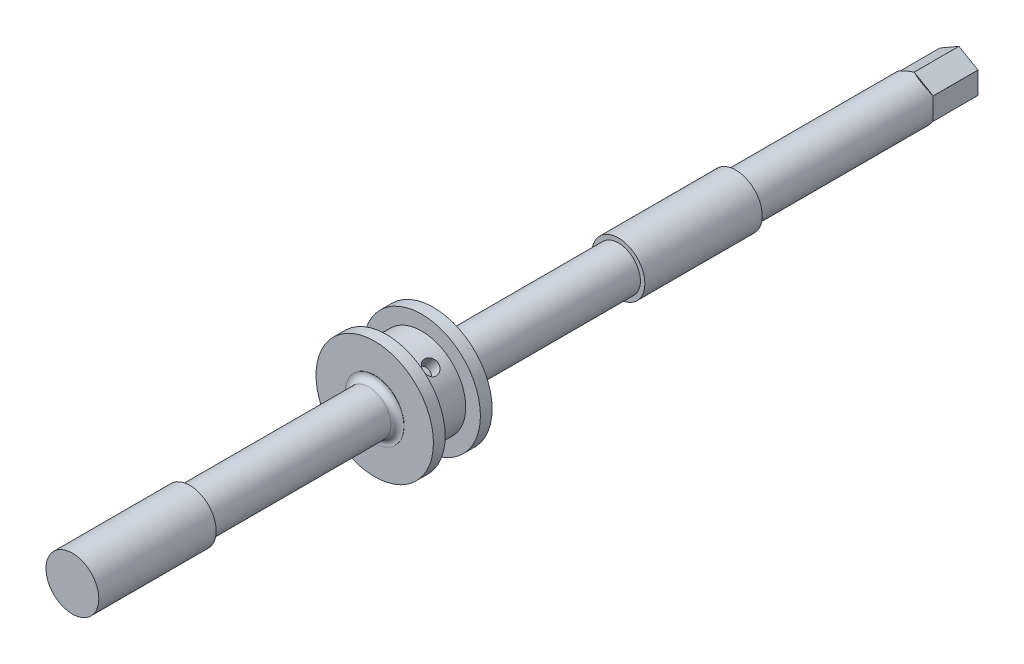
ISO-10303-21;
HEADER;
FILE_DESCRIPTION(('STEP AP214'),'2;1');
FILE_NAME('part.step','',(''),(''),'','','');
FILE_SCHEMA(('AUTOMOTIVE_DESIGN { 1 0 10303 214 1 1 1 1 }'));
ENDSEC;
DATA;
#1=APPLICATION_CONTEXT('core data for automotive mechanical design processes');
#2=APPLICATION_PROTOCOL_DEFINITION('international standard','automotive_design',2000,#1);
#3=PRODUCT_CONTEXT('',#1,'mechanical');
#4=PRODUCT('Part','Part','',(#3));
#5=PRODUCT_RELATED_PRODUCT_CATEGORY('part','',(#4));
#6=PRODUCT_DEFINITION_FORMATION('','',#4);
#7=PRODUCT_DEFINITION_CONTEXT('part definition',#1,'design');
#8=PRODUCT_DEFINITION('design','',#6,#7);
#9=PRODUCT_DEFINITION_SHAPE('','',#8);
#10=(LENGTH_UNIT() NAMED_UNIT(*) SI_UNIT(.MILLI.,.METRE.));
#11=(NAMED_UNIT(*) PLANE_ANGLE_UNIT() SI_UNIT($,.RADIAN.));
#12=(NAMED_UNIT(*) SI_UNIT($,.STERADIAN.) SOLID_ANGLE_UNIT());
#13=UNCERTAINTY_MEASURE_WITH_UNIT(LENGTH_MEASURE(1.E-05),#10,'distance_accuracy_value','');
#14=(GEOMETRIC_REPRESENTATION_CONTEXT(3) GLOBAL_UNCERTAINTY_ASSIGNED_CONTEXT((#13)) GLOBAL_UNIT_ASSIGNED_CONTEXT((#10,
#11,#12)) REPRESENTATION_CONTEXT('',''));
#15=CARTESIAN_POINT('',(0.,0.,0.));
#16=DIRECTION('',(0.,0.,1.));
#17=DIRECTION('',(1.,0.,0.));
#18=AXIS2_PLACEMENT_3D('',#15,#16,#17);
#19=CARTESIAN_POINT('',(0.,-7.50555349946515,-172.25));
#20=DIRECTION('',(-0.5,-0.86602540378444,0.));
#21=DIRECTION('',(0.86602540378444,-0.5,0.));
#22=AXIS2_PLACEMENT_3D('',#19,#20,#21);
#23=PLANE('',#22);
#24=DIRECTION('',(-0.86602540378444,0.5,0.));
#25=VECTOR('',#24,1.);
#26=CARTESIAN_POINT('',(-3.25000000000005,-5.62916512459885,-189.));
#27=LINE('',#26,#25);
#28=CARTESIAN_POINT('',(-0.00962965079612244,-7.49999381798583,-189.));
#29=VERTEX_POINT('',#28);
#30=CARTESIAN_POINT('',(-6.49037034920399,-3.75833643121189,-189.));
#31=VERTEX_POINT('',#30);
#32=EDGE_CURVE('E22',#29,#31,#27,.T.);
#33=ORIENTED_EDGE('',*,*,#32,.F.);
#34=DIRECTION('',(0.,0.,-1.));
#35=VECTOR('',#34,1.);
#36=CARTESIAN_POINT('',(-0.00962965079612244,-7.49999381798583,-113.));
#37=LINE('',#36,#35);
#38=CARTESIAN_POINT('',(-0.00962965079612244,-7.49999381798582,-173.75));
#39=VERTEX_POINT('',#38);
#40=EDGE_CURVE('E184',#39,#29,#37,.T.);
#41=ORIENTED_EDGE('',*,*,#40,.F.);
#42=DIRECTION('',(0.86602540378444,-0.5,0.));
#43=VECTOR('',#42,1.);
#44=CARTESIAN_POINT('',(0.,-7.50555349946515,-173.75));
#45=LINE('',#44,#43);
#46=CARTESIAN_POINT('',(-6.49037034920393,-3.75833643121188,-173.75));
#47=VERTEX_POINT('',#46);
#48=EDGE_CURVE('E218',#39,#47,#45,.F.);
#49=ORIENTED_EDGE('',*,*,#48,.T.);
#50=DIRECTION('',(0.,0.,-1.));
#51=VECTOR('',#50,1.);
#52=CARTESIAN_POINT('',(-6.49037034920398,-3.75833643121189,-113.));
#53=LINE('',#52,#51);
#54=EDGE_CURVE('E188',#31,#47,#53,.F.);
#55=ORIENTED_EDGE('',*,*,#54,.F.);
#56=EDGE_LOOP('',(#33,#41,#49,#55));
#57=FACE_BOUND('',#56,.T.);
#58=ADVANCED_FACE('F18',(#57),#23,.T.);
#59=CARTESIAN_POINT('',(0.,0.,-189.));
#60=DIRECTION('',(0.,0.,-1.));
#61=DIRECTION('',(-1.,0.,0.));
#62=AXIS2_PLACEMENT_3D('',#59,#60,#61);
#63=PLANE('',#62);
#64=CARTESIAN_POINT('',(0.,0.,-189.));
#65=DIRECTION('',(0.,0.,-1.));
#66=DIRECTION('',(-1.,0.,0.));
#67=AXIS2_PLACEMENT_3D('',#64,#65,#66);
#68=CIRCLE('',#67,7.5);
#69=CARTESIAN_POINT('',(0.00962965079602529,-7.49999381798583,-189.));
#70=VERTEX_POINT('',#69);
#71=EDGE_CURVE('E418',#70,#29,#68,.T.);
#72=ORIENTED_EDGE('',*,*,#71,.T.);
#73=ORIENTED_EDGE('',*,*,#32,.T.);
#74=CARTESIAN_POINT('',(-6.5,-3.74165738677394,-189.));
#75=VERTEX_POINT('',#74);
#76=EDGE_CURVE('E406',#31,#75,#68,.T.);
#77=ORIENTED_EDGE('',*,*,#76,.T.);
#78=DIRECTION('',(0.,1.,0.));
#79=VECTOR('',#78,1.);
#80=CARTESIAN_POINT('',(-6.5,0.,-189.));
#81=LINE('',#80,#79);
#82=CARTESIAN_POINT('',(-6.5,3.74165738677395,-189.));
#83=VERTEX_POINT('',#82);
#84=EDGE_CURVE('E405',#75,#83,#81,.T.);
#85=ORIENTED_EDGE('',*,*,#84,.T.);
#86=CARTESIAN_POINT('',(-6.49037034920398,3.7583364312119,-189.));
#87=VERTEX_POINT('',#86);
#88=EDGE_CURVE('E413',#83,#87,#68,.T.);
#89=ORIENTED_EDGE('',*,*,#88,.T.);
#90=DIRECTION('',(0.86602540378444,0.5,0.));
#91=VECTOR('',#90,1.);
#92=CARTESIAN_POINT('',(-3.25000000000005,5.62916512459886,-189.));
#93=LINE('',#92,#91);
#94=CARTESIAN_POINT('',(-0.00962965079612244,7.49999381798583,-189.));
#95=VERTEX_POINT('',#94);
#96=EDGE_CURVE('E35',#87,#95,#93,.T.);
#97=ORIENTED_EDGE('',*,*,#96,.T.);
#98=CARTESIAN_POINT('',(0.00962965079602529,7.49999381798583,-189.));
#99=VERTEX_POINT('',#98);
#100=EDGE_CURVE('E42',#95,#99,#68,.T.);
#101=ORIENTED_EDGE('',*,*,#100,.T.);
#102=DIRECTION('',(0.86602540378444,-0.5,0.));
#103=VECTOR('',#102,1.);
#104=CARTESIAN_POINT('',(3.24999999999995,5.62916512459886,-189.));
#105=LINE('',#104,#103);
#106=CARTESIAN_POINT('',(6.49037034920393,3.75833643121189,-189.));
#107=VERTEX_POINT('',#106);
#108=EDGE_CURVE('E415',#99,#107,#105,.T.);
#109=ORIENTED_EDGE('',*,*,#108,.T.);
#110=CARTESIAN_POINT('',(6.5,3.74165738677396,-189.));
#111=VERTEX_POINT('',#110);
#112=EDGE_CURVE('E417',#107,#111,#68,.T.);
#113=ORIENTED_EDGE('',*,*,#112,.T.);
#114=DIRECTION('',(0.,-1.,0.));
#115=VECTOR('',#114,1.);
#116=CARTESIAN_POINT('',(6.5,0.,-189.));
#117=LINE('',#116,#115);
#118=CARTESIAN_POINT('',(6.5,-3.74165738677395,-189.));
#119=VERTEX_POINT('',#118);
#120=EDGE_CURVE('E424',#111,#119,#117,.T.);
#121=ORIENTED_EDGE('',*,*,#120,.T.);
#122=CARTESIAN_POINT('',(6.49037034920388,-3.75833643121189,-189.));
#123=VERTEX_POINT('',#122);
#124=EDGE_CURVE('E419',#119,#123,#68,.T.);
#125=ORIENTED_EDGE('',*,*,#124,.T.);
#126=DIRECTION('',(-0.86602540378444,-0.5,0.));
#127=VECTOR('',#126,1.);
#128=CARTESIAN_POINT('',(3.25,-5.62916512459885,-189.));
#129=LINE('',#128,#127);
#130=EDGE_CURVE('E432',#123,#70,#129,.T.);
#131=ORIENTED_EDGE('',*,*,#130,.T.);
#132=EDGE_LOOP('',(#72,#73,#77,#85,#89,#97,#101,#109,#113,#121,#125,#131));
#133=FACE_BOUND('',#132,.T.);
#134=ADVANCED_FACE('F373',(#133),#63,.T.);
#135=CARTESIAN_POINT('',(6.5,-3.75277674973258,-172.25));
#136=DIRECTION('',(0.5,-0.86602540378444,0.));
#137=DIRECTION('',(0.86602540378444,0.5,0.));
#138=AXIS2_PLACEMENT_3D('',#135,#136,#137);
#139=PLANE('',#138);
#140=ORIENTED_EDGE('',*,*,#130,.F.);
#141=DIRECTION('',(0.,0.,-1.));
#142=VECTOR('',#141,1.);
#143=CARTESIAN_POINT('',(6.49037034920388,-3.75833643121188,-113.));
#144=LINE('',#143,#142);
#145=CARTESIAN_POINT('',(6.49037034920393,-3.75833643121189,-173.75));
#146=VERTEX_POINT('',#145);
#147=EDGE_CURVE('E178',#146,#123,#144,.T.);
#148=ORIENTED_EDGE('',*,*,#147,.F.);
#149=DIRECTION('',(0.86602540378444,0.5,0.));
#150=VECTOR('',#149,1.);
#151=CARTESIAN_POINT('',(6.5,-3.75277674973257,-173.75));
#152=LINE('',#151,#150);
#153=CARTESIAN_POINT('',(0.00962965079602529,-7.49999381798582,-173.75));
#154=VERTEX_POINT('',#153);
#155=EDGE_CURVE('E215',#146,#154,#152,.F.);
#156=ORIENTED_EDGE('',*,*,#155,.T.);
#157=DIRECTION('',(0.,0.,-1.));
#158=VECTOR('',#157,1.);
#159=CARTESIAN_POINT('',(0.00962965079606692,-7.49999381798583,-113.));
#160=LINE('',#159,#158);
#161=EDGE_CURVE('E182',#70,#154,#160,.F.);
#162=ORIENTED_EDGE('',*,*,#161,.F.);
#163=EDGE_LOOP('',(#140,#148,#156,#162));
#164=FACE_BOUND('',#163,.T.);
#165=ADVANCED_FACE('F380',(#164),#139,.T.);
#166=CARTESIAN_POINT('',(6.5,3.75277674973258,-172.25));
#167=DIRECTION('',(1.,0.,0.));
#168=DIRECTION('',(0.,0.,-1.));
#169=AXIS2_PLACEMENT_3D('',#166,#167,#168);
#170=PLANE('',#169);
#171=ORIENTED_EDGE('',*,*,#120,.F.);
#172=DIRECTION('',(0.,0.,-1.));
#173=VECTOR('',#172,1.);
#174=CARTESIAN_POINT('',(6.5,3.74165738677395,-113.));
#175=LINE('',#174,#173);
#176=CARTESIAN_POINT('',(6.5,3.74165738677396,-173.75));
#177=VERTEX_POINT('',#176);
#178=EDGE_CURVE('E208',#177,#111,#175,.T.);
#179=ORIENTED_EDGE('',*,*,#178,.F.);
#180=DIRECTION('',(0.,1.,0.));
#181=VECTOR('',#180,1.);
#182=CARTESIAN_POINT('',(6.5,3.75277674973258,-173.75));
#183=LINE('',#182,#181);
#184=CARTESIAN_POINT('',(6.5,-3.74165738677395,-173.75));
#185=VERTEX_POINT('',#184);
#186=EDGE_CURVE('E212',#185,#177,#183,.T.);
#187=ORIENTED_EDGE('',*,*,#186,.F.);
#188=DIRECTION('',(0.,0.,-1.));
#189=VECTOR('',#188,1.);
#190=CARTESIAN_POINT('',(6.5,-3.74165738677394,-113.));
#191=LINE('',#190,#189);
#192=EDGE_CURVE('E175',#119,#185,#191,.F.);
#193=ORIENTED_EDGE('',*,*,#192,.F.);
#194=EDGE_LOOP('',(#171,#179,#187,#193));
#195=FACE_BOUND('',#194,.T.);
#196=ADVANCED_FACE('F431',(#195),#170,.T.);
#197=CARTESIAN_POINT('',(0.,7.50555349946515,-172.25));
#198=DIRECTION('',(0.5,0.86602540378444,0.));
#199=DIRECTION('',(-0.86602540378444,0.5,0.));
#200=AXIS2_PLACEMENT_3D('',#197,#198,#199);
#201=PLANE('',#200);
#202=ORIENTED_EDGE('',*,*,#108,.F.);
#203=DIRECTION('',(0.,0.,-1.));
#204=VECTOR('',#203,1.);
#205=CARTESIAN_POINT('',(0.00962965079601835,7.49999381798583,-113.));
#206=LINE('',#205,#204);
#207=CARTESIAN_POINT('',(0.00962965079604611,7.49999381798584,-173.75));
#208=VERTEX_POINT('',#207);
#209=EDGE_CURVE('E202',#208,#99,#206,.T.);
#210=ORIENTED_EDGE('',*,*,#209,.F.);
#211=DIRECTION('',(-0.86602540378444,0.5,0.));
#212=VECTOR('',#211,1.);
#213=CARTESIAN_POINT('',(0.,7.50555349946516,-173.75));
#214=LINE('',#213,#212);
#215=CARTESIAN_POINT('',(6.49037034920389,3.75833643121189,-173.75));
#216=VERTEX_POINT('',#215);
#217=EDGE_CURVE('E227',#208,#216,#214,.F.);
#218=ORIENTED_EDGE('',*,*,#217,.T.);
#219=DIRECTION('',(0.,0.,-1.));
#220=VECTOR('',#219,1.);
#221=CARTESIAN_POINT('',(6.49037034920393,3.75833643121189,-113.));
#222=LINE('',#221,#220);
#223=EDGE_CURVE('E206',#107,#216,#222,.F.);
#224=ORIENTED_EDGE('',*,*,#223,.F.);
#225=EDGE_LOOP('',(#202,#210,#218,#224));
#226=FACE_BOUND('',#225,.T.);
#227=ADVANCED_FACE('F496',(#226),#201,.T.);
#228=CARTESIAN_POINT('',(-6.5,3.75277674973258,-172.25));
#229=DIRECTION('',(-0.5,0.86602540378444,0.));
#230=DIRECTION('',(-0.86602540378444,-0.5,0.));
#231=AXIS2_PLACEMENT_3D('',#228,#229,#230);
#232=PLANE('',#231);
#233=ORIENTED_EDGE('',*,*,#96,.F.);
#234=DIRECTION('',(0.,0.,-1.));
#235=VECTOR('',#234,1.);
#236=CARTESIAN_POINT('',(-6.49037034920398,3.75833643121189,-113.));
#237=LINE('',#236,#235);
#238=CARTESIAN_POINT('',(-6.49037034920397,3.7583364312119,-173.75));
#239=VERTEX_POINT('',#238);
#240=EDGE_CURVE('E196',#239,#87,#237,.T.);
#241=ORIENTED_EDGE('',*,*,#240,.F.);
#242=DIRECTION('',(-0.86602540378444,-0.5,0.));
#243=VECTOR('',#242,1.);
#244=CARTESIAN_POINT('',(-6.5,3.75277674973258,-173.75));
#245=LINE('',#244,#243);
#246=CARTESIAN_POINT('',(-0.0096296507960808,7.49999381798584,-173.75));
#247=VERTEX_POINT('',#246);
#248=EDGE_CURVE('E224',#239,#247,#245,.F.);
#249=ORIENTED_EDGE('',*,*,#248,.T.);
#250=DIRECTION('',(0.,0.,-1.));
#251=VECTOR('',#250,1.);
#252=CARTESIAN_POINT('',(-0.00962965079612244,7.49999381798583,-113.));
#253=LINE('',#252,#251);
#254=EDGE_CURVE('E200',#95,#247,#253,.F.);
#255=ORIENTED_EDGE('',*,*,#254,.F.);
#256=EDGE_LOOP('',(#233,#241,#249,#255));
#257=FACE_BOUND('',#256,.T.);
#258=ADVANCED_FACE('F493',(#257),#232,.T.);
#259=CARTESIAN_POINT('',(0.,0.,-113.));
#260=DIRECTION('',(0.,0.,-1.));
#261=DIRECTION('',(-1.,0.,0.));
#262=AXIS2_PLACEMENT_3D('',#259,#260,#261);
#263=CYLINDRICAL_SURFACE('',#262,7.5);
#264=CARTESIAN_POINT('',(0.,0.,-113.));
#265=DIRECTION('',(0.,0.,-1.));
#266=DIRECTION('',(-1.,0.,0.));
#267=AXIS2_PLACEMENT_3D('',#264,#265,#266);
#268=CIRCLE('',#267,7.5);
#269=CARTESIAN_POINT('',(-7.50000000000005,0.,-113.));
#270=VERTEX_POINT('',#269);
#271=EDGE_CURVE('E131',#270,#270,#268,.F.);
#272=ORIENTED_EDGE('',*,*,#271,.F.);
#273=EDGE_LOOP('',(#272));
#274=FACE_BOUND('',#273,.T.);
#275=ORIENTED_EDGE('',*,*,#88,.F.);
#276=DIRECTION('',(0.,0.,-1.));
#277=VECTOR('',#276,1.);
#278=CARTESIAN_POINT('',(-6.50000000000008,3.74165738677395,-113.));
#279=LINE('',#278,#277);
#280=CARTESIAN_POINT('',(-6.5,3.74165738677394,-173.75));
#281=VERTEX_POINT('',#280);
#282=EDGE_CURVE('E194',#83,#281,#279,.F.);
#283=ORIENTED_EDGE('',*,*,#282,.T.);
#284=CARTESIAN_POINT('',(0.,0.,-180.25));
#285=DIRECTION('',(-0.707106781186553,0.,-0.707106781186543));
#286=DIRECTION('',(0.707106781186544,0.,-0.707106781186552));
#287=AXIS2_PLACEMENT_3D('',#284,#285,#286);
#288=ELLIPSE('',#287,10.6066017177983,7.5);
#289=CARTESIAN_POINT('',(-6.5,-3.74165738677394,-173.75));
#290=VERTEX_POINT('',#289);
#291=EDGE_CURVE('E193',#281,#290,#288,.F.);
#292=ORIENTED_EDGE('',*,*,#291,.T.);
#293=DIRECTION('',(0.,0.,-1.));
#294=VECTOR('',#293,1.);
#295=CARTESIAN_POINT('',(-6.5,-3.74165738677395,-113.));
#296=LINE('',#295,#294);
#297=EDGE_CURVE('E190',#290,#75,#296,.T.);
#298=ORIENTED_EDGE('',*,*,#297,.T.);
#299=ORIENTED_EDGE('',*,*,#76,.F.);
#300=ORIENTED_EDGE('',*,*,#54,.T.);
#301=CARTESIAN_POINT('',(0.,0.,-180.25));
#302=DIRECTION('',(-0.353553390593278,-0.612372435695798,-0.707106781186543));
#303=DIRECTION('',(0.353553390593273,0.612372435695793,-0.707106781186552));
#304=AXIS2_PLACEMENT_3D('',#301,#302,#303);
#305=ELLIPSE('',#304,10.6066017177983,7.5);
#306=EDGE_CURVE('E187',#47,#39,#305,.F.);
#307=ORIENTED_EDGE('',*,*,#306,.T.);
#308=ORIENTED_EDGE('',*,*,#40,.T.);
#309=ORIENTED_EDGE('',*,*,#71,.F.);
#310=ORIENTED_EDGE('',*,*,#161,.T.);
#311=CARTESIAN_POINT('',(0.,0.,-180.25));
#312=DIRECTION('',(0.353553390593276,-0.612372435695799,-0.707106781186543));
#313=DIRECTION('',(-0.353553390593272,0.612372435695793,-0.707106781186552));
#314=AXIS2_PLACEMENT_3D('',#311,#312,#313);
#315=ELLIPSE('',#314,10.6066017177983,7.5);
#316=EDGE_CURVE('E181',#154,#146,#315,.F.);
#317=ORIENTED_EDGE('',*,*,#316,.T.);
#318=ORIENTED_EDGE('',*,*,#147,.T.);
#319=ORIENTED_EDGE('',*,*,#124,.F.);
#320=ORIENTED_EDGE('',*,*,#192,.T.);
#321=CARTESIAN_POINT('',(0.,0.,-180.25));
#322=DIRECTION('',(0.707106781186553,0.,-0.707106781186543));
#323=DIRECTION('',(-0.707106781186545,0.,-0.707106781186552));
#324=AXIS2_PLACEMENT_3D('',#321,#322,#323);
#325=ELLIPSE('',#324,10.6066017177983,7.5);
#326=EDGE_CURVE('E177',#185,#177,#325,.F.);
#327=ORIENTED_EDGE('',*,*,#326,.T.);
#328=ORIENTED_EDGE('',*,*,#178,.T.);
#329=ORIENTED_EDGE('',*,*,#112,.F.);
#330=ORIENTED_EDGE('',*,*,#223,.T.);
#331=CARTESIAN_POINT('',(0.,0.,-180.25));
#332=DIRECTION('',(0.353553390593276,0.612372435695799,-0.707106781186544));
#333=DIRECTION('',(-0.353553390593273,-0.612372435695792,-0.707106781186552));
#334=AXIS2_PLACEMENT_3D('',#331,#332,#333);
#335=ELLIPSE('',#334,10.6066017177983,7.5);
#336=EDGE_CURVE('E205',#216,#208,#335,.F.);
#337=ORIENTED_EDGE('',*,*,#336,.T.);
#338=ORIENTED_EDGE('',*,*,#209,.T.);
#339=ORIENTED_EDGE('',*,*,#100,.F.);
#340=ORIENTED_EDGE('',*,*,#254,.T.);
#341=CARTESIAN_POINT('',(0.,0.,-180.25));
#342=DIRECTION('',(-0.353553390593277,0.612372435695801,-0.707106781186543));
#343=DIRECTION('',(0.353553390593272,-0.612372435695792,-0.707106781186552));
#344=AXIS2_PLACEMENT_3D('',#341,#342,#343);
#345=ELLIPSE('',#344,10.6066017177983,7.5);
#346=EDGE_CURVE('E199',#247,#239,#345,.F.);
#347=ORIENTED_EDGE('',*,*,#346,.T.);
#348=ORIENTED_EDGE('',*,*,#240,.T.);
#349=EDGE_LOOP('',(#275,#283,#292,#298,#299,#300,#307,#308,#309,#310,#317,#318,#319,#320,#327,
#328,#329,#330,#337,#338,#339,#340,#347,#348));
#350=FACE_BOUND('',#349,.T.);
#351=ADVANCED_FACE('F20',(#274,#350),#263,.T.);
#352=CARTESIAN_POINT('',(0.,0.,-113.));
#353=DIRECTION('',(0.,0.,-1.));
#354=DIRECTION('',(-1.,0.,0.));
#355=AXIS2_PLACEMENT_3D('',#352,#353,#354);
#356=PLANE('',#355);
#357=ORIENTED_EDGE('',*,*,#271,.T.);
#358=EDGE_LOOP('',(#357));
#359=FACE_BOUND('',#358,.T.);
#360=CARTESIAN_POINT('',(0.,0.,-113.));
#361=DIRECTION('',(0.,0.,-1.));
#362=DIRECTION('',(-1.,0.,0.));
#363=AXIS2_PLACEMENT_3D('',#360,#361,#362);
#364=CIRCLE('',#363,9.);
#365=CARTESIAN_POINT('',(-9.00000000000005,0.,-113.));
#366=VERTEX_POINT('',#365);
#367=EDGE_CURVE('E407',#366,#366,#364,.T.);
#368=ORIENTED_EDGE('',*,*,#367,.T.);
#369=EDGE_LOOP('',(#368));
#370=FACE_BOUND('',#369,.T.);
#371=ADVANCED_FACE('F450',(#359,#370),#356,.T.);
#372=CARTESIAN_POINT('',(0.,7.50555349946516,-173.75));
#373=DIRECTION('',(0.353553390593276,0.612372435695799,-0.707106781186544));
#374=DIRECTION('',(0.,0.755928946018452,0.654653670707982));
#375=AXIS2_PLACEMENT_3D('',#372,#373,#374);
#376=PLANE('',#375);
#377=ORIENTED_EDGE('',*,*,#217,.F.);
#378=ORIENTED_EDGE('',*,*,#336,.F.);
#379=EDGE_LOOP('',(#377,#378));
#380=FACE_BOUND('',#379,.T.);
#381=ADVANCED_FACE('F454',(#380),#376,.T.);
#382=CARTESIAN_POINT('',(-6.5,3.75277674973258,-173.75));
#383=DIRECTION('',(-0.353553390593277,0.612372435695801,-0.707106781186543));
#384=DIRECTION('',(0.,0.755928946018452,0.654653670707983));
#385=AXIS2_PLACEMENT_3D('',#382,#383,#384);
#386=PLANE('',#385);
#387=ORIENTED_EDGE('',*,*,#248,.F.);
#388=ORIENTED_EDGE('',*,*,#346,.F.);
#389=EDGE_LOOP('',(#387,#388));
#390=FACE_BOUND('',#389,.T.);
#391=ADVANCED_FACE('F398',(#390),#386,.T.);
#392=CARTESIAN_POINT('',(-6.5,-3.75277674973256,-173.75));
#393=DIRECTION('',(-0.707106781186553,0.,-0.707106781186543));
#394=DIRECTION('',(-0.707106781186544,0.,0.707106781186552));
#395=AXIS2_PLACEMENT_3D('',#392,#393,#394);
#396=PLANE('',#395);
#397=ORIENTED_EDGE('',*,*,#291,.F.);
#398=DIRECTION('',(0.,1.,0.));
#399=VECTOR('',#398,1.);
#400=CARTESIAN_POINT('',(-6.5,-3.75277674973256,-173.75));
#401=LINE('',#400,#399);
#402=EDGE_CURVE('E221',#290,#281,#401,.T.);
#403=ORIENTED_EDGE('',*,*,#402,.F.);
#404=EDGE_LOOP('',(#397,#403));
#405=FACE_BOUND('',#404,.T.);
#406=ADVANCED_FACE('F388',(#405),#396,.T.);
#407=CARTESIAN_POINT('',(-6.5,-3.75277674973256,-172.25));
#408=DIRECTION('',(-1.,0.,0.));
#409=DIRECTION('',(0.,0.,1.));
#410=AXIS2_PLACEMENT_3D('',#407,#408,#409);
#411=PLANE('',#410);
#412=ORIENTED_EDGE('',*,*,#84,.F.);
#413=ORIENTED_EDGE('',*,*,#297,.F.);
#414=ORIENTED_EDGE('',*,*,#402,.T.);
#415=ORIENTED_EDGE('',*,*,#282,.F.);
#416=EDGE_LOOP('',(#412,#413,#414,#415));
#417=FACE_BOUND('',#416,.T.);
#418=ADVANCED_FACE('F385',(#417),#411,.T.);
#419=CARTESIAN_POINT('',(0.,-7.50555349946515,-173.75));
#420=DIRECTION('',(-0.353553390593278,-0.612372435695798,-0.707106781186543));
#421=DIRECTION('',(0.,0.755928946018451,-0.654653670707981));
#422=AXIS2_PLACEMENT_3D('',#419,#420,#421);
#423=PLANE('',#422);
#424=ORIENTED_EDGE('',*,*,#48,.F.);
#425=ORIENTED_EDGE('',*,*,#306,.F.);
#426=EDGE_LOOP('',(#424,#425));
#427=FACE_BOUND('',#426,.T.);
#428=ADVANCED_FACE('F387',(#427),#423,.T.);
#429=CARTESIAN_POINT('',(6.5,-3.75277674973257,-173.75));
#430=DIRECTION('',(0.353553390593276,-0.612372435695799,-0.707106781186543));
#431=DIRECTION('',(0.,0.755928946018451,-0.654653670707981));
#432=AXIS2_PLACEMENT_3D('',#429,#430,#431);
#433=PLANE('',#432);
#434=ORIENTED_EDGE('',*,*,#155,.F.);
#435=ORIENTED_EDGE('',*,*,#316,.F.);
#436=EDGE_LOOP('',(#434,#435));
#437=FACE_BOUND('',#436,.T.);
#438=ADVANCED_FACE('F395',(#437),#433,.T.);
#439=CARTESIAN_POINT('',(6.5,3.75277674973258,-173.75));
#440=DIRECTION('',(0.707106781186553,0.,-0.707106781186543));
#441=DIRECTION('',(-0.707106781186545,0.,-0.707106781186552));
#442=AXIS2_PLACEMENT_3D('',#439,#440,#441);
#443=PLANE('',#442);
#444=ORIENTED_EDGE('',*,*,#186,.T.);
#445=ORIENTED_EDGE('',*,*,#326,.F.);
#446=EDGE_LOOP('',(#444,#445));
#447=FACE_BOUND('',#446,.T.);
#448=ADVANCED_FACE('F443',(#447),#443,.T.);
#449=CARTESIAN_POINT('',(0.,0.,-73.));
#450=DIRECTION('',(0.,0.,1.));
#451=DIRECTION('',(1.,0.,0.));
#452=AXIS2_PLACEMENT_3D('',#449,#450,#451);
#453=CYLINDRICAL_SURFACE('',#452,7.5);
#454=CARTESIAN_POINT('',(0.,0.,-12.));
#455=DIRECTION('',(0.,0.,1.));
#456=DIRECTION('',(1.,0.,0.));
#457=AXIS2_PLACEMENT_3D('',#454,#455,#456);
#458=CIRCLE('',#457,7.5);
#459=CARTESIAN_POINT('',(7.5,0.,-12.));
#460=VERTEX_POINT('',#459);
#461=EDGE_CURVE('E164',#460,#460,#458,.F.);
#462=ORIENTED_EDGE('',*,*,#461,.T.);
#463=EDGE_LOOP('',(#462));
#464=FACE_BOUND('',#463,.T.);
#465=CARTESIAN_POINT('',(0.,0.,-73.));
#466=DIRECTION('',(0.,0.,1.));
#467=DIRECTION('',(1.,0.,0.));
#468=AXIS2_PLACEMENT_3D('',#465,#466,#467);
#469=CIRCLE('',#468,7.5);
#470=CARTESIAN_POINT('',(7.49999999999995,0.,-73.));
#471=VERTEX_POINT('',#470);
#472=EDGE_CURVE('E125',#471,#471,#469,.T.);
#473=ORIENTED_EDGE('',*,*,#472,.T.);
#474=EDGE_LOOP('',(#473));
#475=FACE_BOUND('',#474,.T.);
#476=ADVANCED_FACE('F152',(#464,#475),#453,.T.);
#477=CARTESIAN_POINT('',(0.,0.,-73.));
#478=DIRECTION('',(0.,0.,-1.));
#479=DIRECTION('',(-1.,0.,0.));
#480=AXIS2_PLACEMENT_3D('',#477,#478,#479);
#481=PLANE('',#480);
#482=CARTESIAN_POINT('',(0.,0.,-73.));
#483=DIRECTION('',(0.,0.,-1.));
#484=DIRECTION('',(-1.,0.,0.));
#485=AXIS2_PLACEMENT_3D('',#482,#483,#484);
#486=CIRCLE('',#485,9.);
#487=CARTESIAN_POINT('',(-9.00000000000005,0.,-73.));
#488=VERTEX_POINT('',#487);
#489=EDGE_CURVE('E798',#488,#488,#486,.T.);
#490=ORIENTED_EDGE('',*,*,#489,.F.);
#491=EDGE_LOOP('',(#490));
#492=FACE_BOUND('',#491,.T.);
#493=ORIENTED_EDGE('',*,*,#472,.F.);
#494=EDGE_LOOP('',(#493));
#495=FACE_BOUND('',#494,.T.);
#496=ADVANCED_FACE('F151',(#492,#495),#481,.F.);
#497=CARTESIAN_POINT('',(0.,0.,-12.));
#498=DIRECTION('',(0.,0.,1.));
#499=DIRECTION('',(1.,0.,0.));
#500=AXIS2_PLACEMENT_3D('',#497,#498,#499);
#501=TOROIDAL_SURFACE('',#500,9.5,2.);
#502=CARTESIAN_POINT('',(0.,0.,-10.));
#503=DIRECTION('',(0.,0.,-1.));
#504=DIRECTION('',(-1.,0.,0.));
#505=AXIS2_PLACEMENT_3D('',#502,#503,#504);
#506=CIRCLE('',#505,9.5);
#507=CARTESIAN_POINT('',(9.5,0.,-10.));
#508=VERTEX_POINT('',#507);
#509=CARTESIAN_POINT('',(-9.5,0.,-10.));
#510=VERTEX_POINT('',#509);
#511=EDGE_CURVE('E116',#508,#510,#506,.F.);
#512=ORIENTED_EDGE('',*,*,#511,.F.);
#513=CARTESIAN_POINT('',(0.,0.,-10.));
#514=DIRECTION('',(0.,0.,-1.));
#515=DIRECTION('',(1.,0.,0.));
#516=AXIS2_PLACEMENT_3D('',#513,#514,#515);
#517=CIRCLE('',#516,9.5);
#518=EDGE_CURVE('E121',#510,#508,#517,.F.);
#519=ORIENTED_EDGE('',*,*,#518,.F.);
#520=EDGE_LOOP('',(#512,#519));
#521=FACE_BOUND('',#520,.T.);
#522=ORIENTED_EDGE('',*,*,#461,.F.);
#523=EDGE_LOOP('',(#522));
#524=FACE_BOUND('',#523,.T.);
#525=ADVANCED_FACE('F129',(#521,#524),#501,.F.);
#526=CARTESIAN_POINT('',(0.,0.,-10.));
#527=DIRECTION('',(0.,0.,1.));
#528=DIRECTION('',(1.,0.,0.));
#529=AXIS2_PLACEMENT_3D('',#526,#527,#528);
#530=PLANE('',#529);
#531=ORIENTED_EDGE('',*,*,#518,.T.);
#532=ORIENTED_EDGE('',*,*,#511,.T.);
#533=EDGE_LOOP('',(#531,#532));
#534=FACE_BOUND('',#533,.T.);
#535=CARTESIAN_POINT('',(0.,0.,-10.));
#536=DIRECTION('',(0.,0.,1.));
#537=DIRECTION('',(-0.385565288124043,0.922680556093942,0.));
#538=AXIS2_PLACEMENT_3D('',#535,#536,#537);
#539=CIRCLE('',#538,20.);
#540=CARTESIAN_POINT('',(-7.71130576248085,18.4536111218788,-9.99999999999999));
#541=VERTEX_POINT('',#540);
#542=EDGE_CURVE('E275',#541,#541,#539,.T.);
#543=ORIENTED_EDGE('',*,*,#542,.F.);
#544=EDGE_LOOP('',(#543));
#545=FACE_BOUND('',#544,.T.);
#546=ADVANCED_FACE('F119',(#534,#545),#530,.F.);
#547=CARTESIAN_POINT('',(0.,0.,172.));
#548=DIRECTION('',(0.,0.,-1.));
#549=DIRECTION('',(-1.,0.,0.));
#550=AXIS2_PLACEMENT_3D('',#547,#548,#549);
#551=CYLINDRICAL_SURFACE('',#550,9.);
#552=ORIENTED_EDGE('',*,*,#367,.F.);
#553=EDGE_LOOP('',(#552));
#554=FACE_BOUND('',#553,.T.);
#555=ORIENTED_EDGE('',*,*,#489,.T.);
#556=EDGE_LOOP('',(#555));
#557=FACE_BOUND('',#556,.T.);
#558=ADVANCED_FACE('F484',(#554,#557),#551,.T.);
#559=CARTESIAN_POINT('',(0.,0.,10.));
#560=DIRECTION('',(0.,0.,-1.));
#561=DIRECTION('',(0.385565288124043,-0.922680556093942,0.));
#562=AXIS2_PLACEMENT_3D('',#559,#560,#561);
#563=CYLINDRICAL_SURFACE('',#562,20.);
#564=CARTESIAN_POINT('',(0.,0.,10.));
#565=DIRECTION('',(0.,0.,1.));
#566=DIRECTION('',(-0.385565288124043,0.922680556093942,0.));
#567=AXIS2_PLACEMENT_3D('',#564,#565,#566);
#568=CIRCLE('',#567,20.);
#569=CARTESIAN_POINT('',(-7.71130576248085,18.4536111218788,10.));
#570=VERTEX_POINT('',#569);
#571=EDGE_CURVE('E267',#570,#570,#568,.F.);
#572=ORIENTED_EDGE('',*,*,#571,.T.);
#573=EDGE_LOOP('',(#572));
#574=FACE_BOUND('',#573,.T.);
#575=CARTESIAN_POINT('',(0.,0.,6.));
#576=DIRECTION('',(0.,0.,1.));
#577=DIRECTION('',(-0.385565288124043,0.922680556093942,0.));
#578=AXIS2_PLACEMENT_3D('',#575,#576,#577);
#579=CIRCLE('',#578,20.);
#580=CARTESIAN_POINT('',(-7.71130576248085,18.4536111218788,6.00000000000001));
#581=VERTEX_POINT('',#580);
#582=EDGE_CURVE('E281',#581,#581,#579,.T.);
#583=ORIENTED_EDGE('',*,*,#582,.T.);
#584=EDGE_LOOP('',(#583));
#585=FACE_BOUND('',#584,.T.);
#586=ADVANCED_FACE('F486',(#574,#585),#563,.T.);
#587=CARTESIAN_POINT('',(0.,0.,-6.));
#588=DIRECTION('',(0.,0.,1.));
#589=DIRECTION('',(-0.385565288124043,0.922680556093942,0.));
#590=AXIS2_PLACEMENT_3D('',#587,#588,#589);
#591=PLANE('',#590);
#592=CARTESIAN_POINT('',(0.,0.,-6.));
#593=DIRECTION('',(0.,0.,1.));
#594=DIRECTION('',(-0.385565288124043,0.922680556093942,0.));
#595=AXIS2_PLACEMENT_3D('',#592,#593,#594);
#596=CIRCLE('',#595,15.);
#597=CARTESIAN_POINT('',(-5.78347932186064,13.8402083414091,-5.99999999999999));
#598=VERTEX_POINT('',#597);
#599=EDGE_CURVE('E264',#598,#598,#596,.T.);
#600=ORIENTED_EDGE('',*,*,#599,.F.);
#601=EDGE_LOOP('',(#600));
#602=FACE_BOUND('',#601,.T.);
#603=CARTESIAN_POINT('',(0.,0.,-6.));
#604=DIRECTION('',(0.,0.,1.));
#605=DIRECTION('',(-0.385565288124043,0.922680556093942,0.));
#606=AXIS2_PLACEMENT_3D('',#603,#604,#605);
#607=CIRCLE('',#606,20.);
#608=CARTESIAN_POINT('',(-7.71130576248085,18.4536111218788,-5.99999999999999));
#609=VERTEX_POINT('',#608);
#610=EDGE_CURVE('E278',#609,#609,#607,.T.);
#611=ORIENTED_EDGE('',*,*,#610,.T.);
#612=EDGE_LOOP('',(#611));
#613=FACE_BOUND('',#612,.T.);
#614=ADVANCED_FACE('F623',(#602,#613),#591,.T.);
#615=CARTESIAN_POINT('',(0.,0.,10.));
#616=DIRECTION('',(0.,0.,1.));
#617=DIRECTION('',(-0.385565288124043,0.922680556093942,0.));
#618=AXIS2_PLACEMENT_3D('',#615,#616,#617);
#619=PLANE('',#618);
#620=CARTESIAN_POINT('',(0.,0.,10.));
#621=DIRECTION('',(0.,0.,1.));
#622=DIRECTION('',(0.,-1.,0.));
#623=AXIS2_PLACEMENT_3D('',#620,#621,#622);
#624=CIRCLE('',#623,10.);
#625=CARTESIAN_POINT('',(0.,-9.99999999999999,10.));
#626=VERTEX_POINT('',#625);
#627=EDGE_CURVE('E11',#626,#626,#624,.F.);
#628=ORIENTED_EDGE('',*,*,#627,.T.);
#629=EDGE_LOOP('',(#628));
#630=FACE_BOUND('',#629,.T.);
#631=ORIENTED_EDGE('',*,*,#571,.F.);
#632=EDGE_LOOP('',(#631));
#633=FACE_BOUND('',#632,.T.);
#634=ADVANCED_FACE('F310',(#630,#633),#619,.T.);
#635=CARTESIAN_POINT('',(0.,0.,10.));
#636=DIRECTION('',(0.,0.,-1.));
#637=DIRECTION('',(0.385565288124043,-0.922680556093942,0.));
#638=AXIS2_PLACEMENT_3D('',#635,#636,#637);
#639=CYLINDRICAL_SURFACE('',#638,20.);
#640=ORIENTED_EDGE('',*,*,#610,.F.);
#641=EDGE_LOOP('',(#640));
#642=FACE_BOUND('',#641,.T.);
#643=ORIENTED_EDGE('',*,*,#542,.T.);
#644=EDGE_LOOP('',(#643));
#645=FACE_BOUND('',#644,.T.);
#646=ADVANCED_FACE('F328',(#642,#645),#639,.T.);
#647=CARTESIAN_POINT('',(-14.87771167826,1.91146415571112,0.));
#648=DIRECTION('',(-0.99184744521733,0.127430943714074,0.));
#649=DIRECTION('',(-0.127430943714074,-0.99184744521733,0.));
#650=AXIS2_PLACEMENT_3D('',#647,#648,#649);
#651=CYLINDRICAL_SURFACE('',#650,2.5);
#652=CARTESIAN_POINT('',(-10.1664363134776,1.30616717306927,-2.5));
#653=CARTESIAN_POINT('',(-10.1488184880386,1.44327509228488,-2.49999593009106));
#654=CARTESIAN_POINT('',(-10.1283981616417,1.58006950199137,-2.48849601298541));
#655=CARTESIAN_POINT('',(-10.082764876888,1.84905409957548,-2.44286472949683));
#656=CARTESIAN_POINT('',(-10.0575490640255,1.98124148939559,-2.40871985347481));
#657=CARTESIAN_POINT('',(-10.0037293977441,2.23718315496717,-2.31895383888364));
#658=CARTESIAN_POINT('',(-9.97512953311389,2.36094709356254,-2.26335781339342));
#659=CARTESIAN_POINT('',(-9.91628223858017,2.59705025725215,-2.13235429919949));
#660=CARTESIAN_POINT('',(-9.88603477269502,2.70938923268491,-2.05694637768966));
#661=CARTESIAN_POINT('',(-9.82537008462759,2.92182048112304,-1.88689204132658));
#662=CARTESIAN_POINT('',(-9.79495929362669,3.02166152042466,-1.79192947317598));
#663=CARTESIAN_POINT('',(-9.73673749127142,3.2043179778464,-1.58613874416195));
#664=CARTESIAN_POINT('',(-9.70892676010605,3.28713156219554,-1.4753088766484));
#665=CARTESIAN_POINT('',(-9.65772456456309,3.43468502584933,-1.23900740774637));
#666=CARTESIAN_POINT('',(-9.63440073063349,3.49915442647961,-1.11335185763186));
#667=CARTESIAN_POINT('',(-9.59468620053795,3.60663306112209,-0.852153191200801));
#668=CARTESIAN_POINT('',(-9.5782944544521,3.64964554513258,-0.716611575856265));
#669=CARTESIAN_POINT('',(-9.55418511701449,3.71229886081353,-0.442230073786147));
#670=CARTESIAN_POINT('',(-9.54630761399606,3.73237098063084,-0.30350285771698));
#671=CARTESIAN_POINT('',(-9.53940685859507,3.74997511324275,-0.0244172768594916));
#672=CARTESIAN_POINT('',(-9.54038223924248,3.74751060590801,0.115940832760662));
#673=CARTESIAN_POINT('',(-9.55096654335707,3.7204477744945,0.390890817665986));
#674=CARTESIAN_POINT('',(-9.56037652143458,3.69635946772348,0.52554107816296));
#675=CARTESIAN_POINT('',(-9.58672259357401,3.62747801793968,0.788661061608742));
#676=CARTESIAN_POINT('',(-9.60365920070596,3.58268346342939,0.917130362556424));
#677=CARTESIAN_POINT('',(-9.64383145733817,3.4731016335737,1.16568011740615));
#678=CARTESIAN_POINT('',(-9.66712642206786,3.40812525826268,1.28566746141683));
#679=CARTESIAN_POINT('',(-9.71807755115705,3.25999793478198,1.51281834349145));
#680=CARTESIAN_POINT('',(-9.74573444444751,3.17684394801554,1.61997973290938));
#681=CARTESIAN_POINT('',(-9.80412396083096,2.99187082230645,1.82148398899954));
#682=CARTESIAN_POINT('',(-9.83491960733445,2.88960708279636,1.91540097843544));
#683=CARTESIAN_POINT('',(-9.89665461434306,2.67051690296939,2.08431275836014));
#684=CARTESIAN_POINT('',(-9.9275939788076,2.55369005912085,2.15930702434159));
#685=CARTESIAN_POINT('',(-9.98756443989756,2.30804473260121,2.28839026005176));
#686=CARTESIAN_POINT('',(-10.0165892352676,2.17918972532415,2.34241280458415));
#687=CARTESIAN_POINT('',(-10.0707511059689,1.91333492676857,2.42746827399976));
#688=CARTESIAN_POINT('',(-10.0958888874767,1.77633662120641,2.45850537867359));
#689=CARTESIAN_POINT('',(-10.1403443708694,1.50160103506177,2.49606490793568));
#690=CARTESIAN_POINT('',(-10.1597892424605,1.36396355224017,2.50316764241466));
#691=CARTESIAN_POINT('',(-10.1929540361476,1.08875759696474,2.49424460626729));
#692=CARTESIAN_POINT('',(-10.2066744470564,0.951189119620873,2.47822081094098));
#693=CARTESIAN_POINT('',(-10.2281609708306,0.682060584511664,2.4239785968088));
#694=CARTESIAN_POINT('',(-10.2360078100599,0.550443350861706,2.3860742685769));
#695=CARTESIAN_POINT('',(-10.2465575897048,0.294846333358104,2.28950363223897));
#696=CARTESIAN_POINT('',(-10.2492600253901,0.170867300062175,2.23083528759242));
#697=CARTESIAN_POINT('',(-10.2504827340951,-0.0681473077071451,2.09326020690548));
#698=CARTESIAN_POINT('',(-10.2489308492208,-0.18299415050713,2.01402517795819));
#699=CARTESIAN_POINT('',(-10.242827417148,-0.398248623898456,1.83798806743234));
#700=CARTESIAN_POINT('',(-10.2382753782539,-0.498653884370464,1.74118310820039));
#701=CARTESIAN_POINT('',(-10.2275590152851,-0.68440486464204,1.53006537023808));
#702=CARTESIAN_POINT('',(-10.22135962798,-0.769345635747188,1.41539750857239));
#703=CARTESIAN_POINT('',(-10.2090288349,-0.918619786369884,1.17333916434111));
#704=CARTESIAN_POINT('',(-10.2028974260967,-0.982954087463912,1.04594925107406));
#705=CARTESIAN_POINT('',(-10.1921718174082,-1.08855512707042,0.782754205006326));
#706=CARTESIAN_POINT('',(-10.1875685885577,-1.12995835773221,0.647004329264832));
#707=CARTESIAN_POINT('',(-10.1808739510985,-1.1887802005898,0.370351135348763));
#708=CARTESIAN_POINT('',(-10.1787820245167,-1.20620375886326,0.229448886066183));
#709=CARTESIAN_POINT('',(-10.1775832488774,-1.21627289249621,-0.049385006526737));
#710=CARTESIAN_POINT('',(-10.1783964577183,-1.20958199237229,-0.187292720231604));
#711=CARTESIAN_POINT('',(-10.1826601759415,-1.17314183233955,-0.45997683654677));
#712=CARTESIAN_POINT('',(-10.1861106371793,-1.14339299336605,-0.594753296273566));
#713=CARTESIAN_POINT('',(-10.1949036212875,-1.06211330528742,-0.85668347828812));
#714=CARTESIAN_POINT('',(-10.2002358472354,-1.01070070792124,-0.983874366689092));
#715=CARTESIAN_POINT('',(-10.2116676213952,-0.887771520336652,-1.22809776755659));
#716=CARTESIAN_POINT('',(-10.2177672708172,-0.816252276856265,-1.3451289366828));
#717=CARTESIAN_POINT('',(-10.2294990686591,-0.653204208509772,-1.56885494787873));
#718=CARTESIAN_POINT('',(-10.2351157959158,-0.561221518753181,-1.67521988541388));
#719=CARTESIAN_POINT('',(-10.2441318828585,-0.360957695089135,-1.87146171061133));
#720=CARTESIAN_POINT('',(-10.2475307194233,-0.25267272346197,-1.96133470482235));
#721=CARTESIAN_POINT('',(-10.2506446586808,-0.0208404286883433,-2.12352706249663));
#722=CARTESIAN_POINT('',(-10.2502961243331,0.102935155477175,-2.19552187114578));
#723=CARTESIAN_POINT('',(-10.2444617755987,0.360636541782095,-2.31772957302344));
#724=CARTESIAN_POINT('',(-10.2389797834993,0.494554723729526,-2.3679586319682));
#725=CARTESIAN_POINT('',(-10.2237412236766,0.741473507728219,-2.43744158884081));
#726=CARTESIAN_POINT('',(-10.2150413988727,0.853388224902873,-2.46085155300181));
#727=CARTESIAN_POINT('',(-10.1936795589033,1.07899601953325,-2.49213191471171));
#728=CARTESIAN_POINT('',(-10.1810178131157,1.19268897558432,-2.50000336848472));
#729=CARTESIAN_POINT('',(-10.1664363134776,1.30616717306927,-2.5));
#730=B_SPLINE_CURVE_WITH_KNOTS('',3,(#652,#653,#654,#655,#656,#657,#658,#659,#660,#661,#662,
#663,#664,#665,#666,#667,#668,#669,#670,#671,#672,#673,#674,#675,#676,#677,#678,#679,#680,#681,
#682,#683,#684,#685,#686,#687,#688,#689,#690,#691,#692,#693,#694,#695,#696,#697,#698,#699,#700,
#701,#702,#703,#704,#705,#706,#707,#708,#709,#710,#711,#712,#713,#714,#715,#716,#717,#718,#719,
#720,#721,#722,#723,#724,#725,#726,#727,#728,#729),.UNSPECIFIED.,.T.,.F.,(4,2,2,2,2,2,2,2,2,2,2,
2,2,2,2,2,2,2,2,2,2,2,2,2,2,2,2,2,2,2,2,2,2,2,2,2,2,2,4),(0.,0.414286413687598,
0.828820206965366,1.2428701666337,1.65692917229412,2.07829844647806,2.49971307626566,
2.92705262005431,3.35432741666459,3.77342983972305,4.19246755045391,4.60187425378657,
5.01130886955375,5.42470184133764,5.83816396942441,6.26282636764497,6.68750053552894,
7.11350903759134,7.53944005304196,7.95496668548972,8.37045782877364,8.78012796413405,
9.18983829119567,9.60654054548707,10.023311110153,10.449782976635,10.8762357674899,
11.3001221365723,11.7239210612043,12.1361490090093,12.5483694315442,12.9583683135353,
13.3684213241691,13.7886838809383,14.2090455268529,14.6365567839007,15.0637499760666,
15.4066599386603,15.7495465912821),.UNSPECIFIED.);
#731=CARTESIAN_POINT('',(-10.1664363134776,1.30616717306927,-2.5));
#732=VERTEX_POINT('',#731);
#733=EDGE_CURVE('E314',#732,#732,#730,.T.);
#734=ORIENTED_EDGE('',*,*,#733,.T.);
#735=EDGE_LOOP('',(#734));
#736=FACE_BOUND('',#735,.T.);
#737=CARTESIAN_POINT('',(-14.9881989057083,-0.594889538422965,0.));
#738=CARTESIAN_POINT('',(-14.9882006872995,-0.594883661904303,0.139375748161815));
#739=CARTESIAN_POINT('',(-14.9886838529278,-0.583036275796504,0.278827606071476));
#740=CARTESIAN_POINT('',(-14.9904381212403,-0.536001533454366,0.553818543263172));
#741=CARTESIAN_POINT('',(-14.9917099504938,-0.500792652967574,0.689353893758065));
#742=CARTESIAN_POINT('',(-14.9945160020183,-0.408192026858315,0.952492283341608));
#743=CARTESIAN_POINT('',(-14.9960500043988,-0.350818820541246,1.08010184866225));
#744=CARTESIAN_POINT('',(-14.9986012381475,-0.215658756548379,1.32398095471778));
#745=CARTESIAN_POINT('',(-14.9996185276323,-0.137874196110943,1.44025176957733));
#746=CARTESIAN_POINT('',(-15.0002105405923,0.0366018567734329,1.65931284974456));
#747=CARTESIAN_POINT('',(-14.9997724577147,0.133454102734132,1.76197513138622));
#748=CARTESIAN_POINT('',(-14.99644646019,0.342834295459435,1.94979330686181));
#749=CARTESIAN_POINT('',(-14.9935584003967,0.455363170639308,2.03494816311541));
#750=CARTESIAN_POINT('',(-14.9844311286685,0.693612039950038,2.18581456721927));
#751=CARTESIAN_POINT('',(-14.9781720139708,0.819406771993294,2.25140700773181));
#752=CARTESIAN_POINT('',(-14.9616394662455,1.07998485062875,2.36052107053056));
#753=CARTESIAN_POINT('',(-14.9513662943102,1.21476761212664,2.40404412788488));
#754=CARTESIAN_POINT('',(-14.926627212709,1.48810230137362,2.4673925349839));
#755=CARTESIAN_POINT('',(-14.9122008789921,1.62660795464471,2.4874329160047));
#756=CARTESIAN_POINT('',(-14.8792587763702,1.90452948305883,2.5039157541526));
#757=CARTESIAN_POINT('',(-14.8607432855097,2.0439452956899,2.50035981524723));
#758=CARTESIAN_POINT('',(-14.8204120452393,2.31828119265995,2.46991864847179));
#759=CARTESIAN_POINT('',(-14.7986307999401,2.45323212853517,2.44326483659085));
#760=CARTESIAN_POINT('',(-14.7526072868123,2.71632564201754,2.36774892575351));
#761=CARTESIAN_POINT('',(-14.728364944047,2.84446801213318,2.3188861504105));
#762=CARTESIAN_POINT('',(-14.6785978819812,3.09106379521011,2.20010935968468));
#763=CARTESIAN_POINT('',(-14.6530677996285,3.20947016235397,2.13009998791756));
#764=CARTESIAN_POINT('',(-14.602353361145,3.43284364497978,1.97108717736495));
#765=CARTESIAN_POINT('',(-14.5771690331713,3.53780967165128,1.88208220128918));
#766=CARTESIAN_POINT('',(-14.5284751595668,3.73278026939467,1.68632119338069));
#767=CARTESIAN_POINT('',(-14.5049896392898,3.82258787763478,1.57936290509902));
#768=CARTESIAN_POINT('',(-14.461684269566,3.98329469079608,1.35141290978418));
#769=CARTESIAN_POINT('',(-14.4418644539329,4.05419372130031,1.23042107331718));
#770=CARTESIAN_POINT('',(-14.4073414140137,4.17522429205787,0.977608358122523));
#771=CARTESIAN_POINT('',(-14.3926439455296,4.22533248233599,0.845775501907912));
#772=CARTESIAN_POINT('',(-14.3695448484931,4.3032369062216,0.575150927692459));
#773=CARTESIAN_POINT('',(-14.3611426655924,4.33103510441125,0.436359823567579));
#774=CARTESIAN_POINT('',(-14.3513688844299,4.36331250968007,0.157533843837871));
#775=CARTESIAN_POINT('',(-14.349914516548,4.36806625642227,0.0175336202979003));
#776=CARTESIAN_POINT('',(-14.3539275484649,4.35486047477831,-0.261286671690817));
#777=CARTESIAN_POINT('',(-14.3593946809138,4.336901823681,-0.400106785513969));
#778=CARTESIAN_POINT('',(-14.3767596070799,4.27898100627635,-0.671727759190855));
#779=CARTESIAN_POINT('',(-14.3886165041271,4.2391587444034,-0.804561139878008));
#780=CARTESIAN_POINT('',(-14.4178272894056,4.13871664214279,-1.06147016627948));
#781=CARTESIAN_POINT('',(-14.4351815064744,4.07809555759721,-1.1855452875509));
#782=CARTESIAN_POINT('',(-14.4742947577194,3.93702653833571,-1.42267459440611));
#783=CARTESIAN_POINT('',(-14.496092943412,3.85640088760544,-1.53561657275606));
#784=CARTESIAN_POINT('',(-14.5424481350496,3.67773025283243,-1.746113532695));
#785=CARTESIAN_POINT('',(-14.5670053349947,3.57968404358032,-1.84366743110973));
#786=CARTESIAN_POINT('',(-14.6174971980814,3.36760411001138,-2.0216518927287));
#787=CARTESIAN_POINT('',(-14.6434435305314,3.2534147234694,-2.10189382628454));
#788=CARTESIAN_POINT('',(-14.694817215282,3.01288054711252,-2.24165532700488));
#789=CARTESIAN_POINT('',(-14.7202445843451,2.88653615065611,-2.30117556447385));
#790=CARTESIAN_POINT('',(-14.7689891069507,2.62573169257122,-2.39751058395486));
#791=CARTESIAN_POINT('',(-14.792315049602,2.49130976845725,-2.43442407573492));
#792=CARTESIAN_POINT('',(-14.8358081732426,2.21765129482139,-2.48481559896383));
#793=CARTESIAN_POINT('',(-14.8559756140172,2.07841514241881,-2.49829555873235));
#794=CARTESIAN_POINT('',(-14.8921539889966,1.80086158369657,-2.5013818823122));
#795=CARTESIAN_POINT('',(-14.9082122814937,1.66255345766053,-2.49127525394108));
#796=CARTESIAN_POINT('',(-14.9361698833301,1.38914331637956,-2.44809607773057));
#797=CARTESIAN_POINT('',(-14.9480692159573,1.25404128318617,-2.41502365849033));
#798=CARTESIAN_POINT('',(-14.9678059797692,0.991044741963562,-2.32696183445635));
#799=CARTESIAN_POINT('',(-14.9756479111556,0.86314238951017,-2.27199683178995));
#800=CARTESIAN_POINT('',(-14.9877685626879,0.617963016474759,-2.14174206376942));
#801=CARTESIAN_POINT('',(-14.9920471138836,0.500686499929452,-2.06645133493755));
#802=CARTESIAN_POINT('',(-14.9978259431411,0.27874666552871,-1.8966649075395));
#803=CARTESIAN_POINT('',(-14.9992938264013,0.174243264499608,-1.80195904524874));
#804=CARTESIAN_POINT('',(-15.0002972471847,-0.0176053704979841,-1.59647169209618));
#805=CARTESIAN_POINT('',(-14.9998323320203,-0.104946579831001,-1.48568644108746));
#806=CARTESIAN_POINT('',(-14.997942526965,-0.260435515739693,-1.25025467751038));
#807=CARTESIAN_POINT('',(-14.9965108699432,-0.328443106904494,-1.12551566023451));
#808=CARTESIAN_POINT('',(-14.9935874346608,-0.442273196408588,-0.866390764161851));
#809=CARTESIAN_POINT('',(-14.9920957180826,-0.488117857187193,-0.732014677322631));
#810=CARTESIAN_POINT('',(-14.9900679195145,-0.546281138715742,-0.497596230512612));
#811=CARTESIAN_POINT('',(-14.989380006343,-0.564478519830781,-0.39897319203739));
#812=CARTESIAN_POINT('',(-14.9884448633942,-0.588784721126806,-0.200246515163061));
#813=CARTESIAN_POINT('',(-14.9881976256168,-0.594893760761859,-0.100142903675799));
#814=CARTESIAN_POINT('',(-14.9881989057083,-0.594889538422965,0.));
#815=B_SPLINE_CURVE_WITH_KNOTS('',3,(#737,#738,#739,#740,#741,#742,#743,#744,#745,#746,#747,
#748,#749,#750,#751,#752,#753,#754,#755,#756,#757,#758,#759,#760,#761,#762,#763,#764,#765,#766,
#767,#768,#769,#770,#771,#772,#773,#774,#775,#776,#777,#778,#779,#780,#781,#782,#783,#784,#785,
#786,#787,#788,#789,#790,#791,#792,#793,#794,#795,#796,#797,#798,#799,#800,#801,#802,#803,#804,
#805,#806,#807,#808,#809,#810,#811,#812,#813,#814),.UNSPECIFIED.,.T.,.F.,(4,2,2,2,2,2,2,2,2,2,2,
2,2,2,2,2,2,2,2,2,2,2,2,2,2,2,2,2,2,2,2,2,2,2,2,2,2,2,4),(0.,0.417761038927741,
0.835907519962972,1.25370499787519,1.67145547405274,2.09289159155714,2.51435267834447,
2.93832980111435,3.36227935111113,3.78231567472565,4.20232344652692,4.61817121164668,
5.03403164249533,5.45179604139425,5.86959426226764,6.29246123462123,6.71533210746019,
7.13867662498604,7.56198385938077,7.98023542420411,8.39847083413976,8.81406064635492,
9.22967532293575,9.64912342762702,10.0686010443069,10.4924411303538,10.916267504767,
11.3382298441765,11.7601574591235,12.1769777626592,12.5937957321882,13.0101503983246,
13.4265248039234,13.8476699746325,14.2689137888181,14.6931372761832,15.1169356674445,
15.4171067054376,15.7172722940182),.UNSPECIFIED.);
#816=CARTESIAN_POINT('',(-14.9881989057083,-0.594889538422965,0.));
#817=VERTEX_POINT('',#816);
#818=EDGE_CURVE('E333',#817,#817,#815,.T.);
#819=ORIENTED_EDGE('',*,*,#818,.T.);
#820=EDGE_LOOP('',(#819));
#821=FACE_BOUND('',#820,.T.);
#822=ADVANCED_FACE('F324',(#736,#821),#651,.F.);
#823=CARTESIAN_POINT('',(9.09423235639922,11.9287441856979,0.));
#824=DIRECTION('',(0.606282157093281,0.795249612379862,0.));
#825=DIRECTION('',(-0.795249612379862,0.606282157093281,0.));
#826=AXIS2_PLACEMENT_3D('',#823,#824,#825);
#827=CYLINDRICAL_SURFACE('',#826,2.5);
#828=CARTESIAN_POINT('',(6.21439211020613,8.15130852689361,-2.5));
#829=CARTESIAN_POINT('',(6.32432213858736,8.06749708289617,-2.49999593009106));
#830=CARTESIAN_POINT('',(6.43257940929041,7.98141535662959,-2.48849601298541));
#831=CARTESIAN_POINT('',(6.64271026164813,7.80740347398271,-2.44286472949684));
#832=CARTESIAN_POINT('',(6.74457999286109,7.71947224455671,-2.40871985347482));
#833=CARTESIAN_POINT('',(6.93932214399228,7.54489221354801,-2.31895383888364));
#834=CARTESIAN_POINT('',(7.03220492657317,7.45824203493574,-2.26335781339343));
#835=CARTESIAN_POINT('',(7.20725261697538,7.28922720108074,-2.13235429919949));
#836=CARTESIAN_POINT('',(7.28941729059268,7.2068626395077,-2.05694637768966));
#837=CARTESIAN_POINT('',(7.44305580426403,7.04810985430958,-1.88689204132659));
#838=CARTESIAN_POINT('',(7.51431528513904,6.97185281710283,-1.79192947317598));
#839=CARTESIAN_POINT('',(7.6433895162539,6.83010302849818,-1.58613874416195));
#840=CARTESIAN_POINT('',(7.701202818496,6.76461143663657,-1.4753088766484));
#841=CARTESIAN_POINT('',(7.80338676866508,6.64649230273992,-1.23900740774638));
#842=CARTESIAN_POINT('',(7.84755699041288,6.59405856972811,-1.11335185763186));
#843=CARTESIAN_POINT('',(7.92077895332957,6.50592546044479,-0.852153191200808));
#844=CARTESIAN_POINT('',(7.94983298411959,6.47022354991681,-0.716611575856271));
#845=CARTESIAN_POINT('',(7.99203767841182,6.41801759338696,-0.442230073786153));
#846=CARTESIAN_POINT('',(8.00548189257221,6.40115941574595,-0.303502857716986));
#847=CARTESIAN_POINT('',(8.0172771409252,6.38638111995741,-0.024417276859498));
#848=CARTESIAN_POINT('',(8.01563050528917,6.38845807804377,0.115940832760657));
#849=CARTESIAN_POINT('',(7.99748555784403,6.41115576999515,0.390890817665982));
#850=CARTESIAN_POINT('',(7.98132946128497,6.43134920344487,0.525541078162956));
#851=CARTESIAN_POINT('',(7.93484941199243,6.48860629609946,0.788661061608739));
#852=CARTESIAN_POINT('',(7.90452449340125,6.52567110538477,0.91713036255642));
#853=CARTESIAN_POINT('',(7.82970997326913,6.61525221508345,1.16568011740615));
#854=CARTESIAN_POINT('',(7.78508626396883,6.66791443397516,1.28566746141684));
#855=CARTESIAN_POINT('',(7.68227980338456,6.78610306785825,1.51281834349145));
#856=CARTESIAN_POINT('',(7.62409478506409,6.85163163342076,1.61997973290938));
#857=CARTESIAN_POINT('',(7.49309811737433,6.99468500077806,1.82148398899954));
#858=CARTESIAN_POINT('',(7.41993294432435,7.07248668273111,1.91540097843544));
#859=CARTESIAN_POINT('',(7.2610627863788,7.23549585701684,2.08431275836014));
#860=CARTESIAN_POINT('',(7.17535745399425,7.32070355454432,2.15930702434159));
#861=CARTESIAN_POINT('',(6.9926075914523,7.49546216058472,2.28839026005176));
#862=CARTESIAN_POINT('',(6.89552827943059,7.58502587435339,2.34241280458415));
#863=CARTESIAN_POINT('',(6.69237220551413,7.76485882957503,2.42746827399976));
#864=CARTESIAN_POINT('',(6.58629708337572,7.85512793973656,2.4585053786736));
#865=CARTESIAN_POINT('',(6.3705968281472,8.0309953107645,2.49606490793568));
#866=CARTESIAN_POINT('',(6.2611217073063,8.11665380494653,2.50316764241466));
#867=CARTESIAN_POINT('',(6.03936875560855,8.28297833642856,2.49424460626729));
#868=CARTESIAN_POINT('',(5.9270911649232,8.36364479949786,2.47822081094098));
#869=CARTESIAN_POINT('',(5.70476227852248,8.51681694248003,2.4239785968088));
#870=CARTESIAN_POINT('',(5.59470183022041,8.58942112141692,2.38607426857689));
#871=CARTESIAN_POINT('',(5.37862320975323,8.72635600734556,2.28950363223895));
#872=CARTESIAN_POINT('',(5.27260543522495,8.79068590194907,2.23083528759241));
#873=CARTESIAN_POINT('',(5.06622406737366,8.91125210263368,2.09326020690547));
#874=CARTESIAN_POINT('',(4.9659878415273,8.9673315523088,2.01402517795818));
#875=CARTESIAN_POINT('',(4.77652028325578,9.06967306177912,1.83798806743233));
#876=CARTESIAN_POINT('',(4.68729075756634,9.11593351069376,1.74118310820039));
#877=CARTESIAN_POINT('',(4.5210675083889,9.19952835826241,1.53006537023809));
#878=CARTESIAN_POINT('',(4.44440694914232,9.23662991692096,1.41539750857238));
#879=CARTESIAN_POINT('',(4.3089663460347,9.30058821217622,1.1733391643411));
#880=CARTESIAN_POINT('',(4.25018550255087,9.32744540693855,1.04594925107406));
#881=CARTESIAN_POINT('',(4.15336951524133,9.3709572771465,0.78275420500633));
#882=CARTESIAN_POINT('',(4.11521165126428,9.38767237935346,0.647004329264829));
#883=CARTESIAN_POINT('',(4.06092312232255,9.41128557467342,0.370351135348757));
#884=CARTESIAN_POINT('',(4.04478791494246,9.41818569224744,0.229448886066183));
#885=CARTESIAN_POINT('',(4.0354684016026,9.42218208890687,-0.0493850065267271));
#886=CARTESIAN_POINT('',(4.04166949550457,9.41954089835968,-0.18729272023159));
#887=CARTESIAN_POINT('',(4.0753594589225,9.4050133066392,-0.459976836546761));
#888=CARTESIAN_POINT('',(4.10284793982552,9.39312707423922,-0.594753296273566));
#889=CARTESIAN_POINT('',(4.17763470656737,9.36010217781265,-0.856683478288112));
#890=CARTESIAN_POINT('',(4.22482543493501,9.33901372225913,-0.983874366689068));
#891=CARTESIAN_POINT('',(4.33700112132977,9.28744933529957,-1.22809776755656));
#892=CARTESIAN_POINT('',(4.40198842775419,9.25697216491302,-1.34512893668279));
#893=CARTESIAN_POINT('',(4.54905809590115,9.18560816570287,-1.56885494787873));
#894=CARTESIAN_POINT('',(4.63152580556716,9.14448104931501,-1.67521988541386));
#895=CARTESIAN_POINT('',(4.80946740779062,9.05215729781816,-1.87146171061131));
#896=CARTESIAN_POINT('',(4.90494436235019,9.00095829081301,-1.96133470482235));
#897=CARTESIAN_POINT('',(5.10727398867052,8.88773889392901,-2.12352706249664));
#898=CARTESIAN_POINT('',(5.21429252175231,8.82554926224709,-2.19552187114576));
#899=CARTESIAN_POINT('',(5.43455129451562,8.69164587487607,-2.31772957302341));
#900=CARTESIAN_POINT('',(5.54778684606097,8.61993923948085,-2.3679586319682));
#901=CARTESIAN_POINT('',(5.75400550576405,8.48328286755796,-2.43744158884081));
#902=CARTESIAN_POINT('',(5.84657658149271,8.41979123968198,-2.4608515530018));
#903=CARTESIAN_POINT('',(6.03127774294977,8.28848744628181,-2.4921319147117));
#904=CARTESIAN_POINT('',(6.12340785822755,8.22067557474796,-2.50000336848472));
#905=CARTESIAN_POINT('',(6.21439211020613,8.15130852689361,-2.5));
#906=B_SPLINE_CURVE_WITH_KNOTS('',3,(#828,#829,#830,#831,#832,#833,#834,#835,#836,#837,#838,
#839,#840,#841,#842,#843,#844,#845,#846,#847,#848,#849,#850,#851,#852,#853,#854,#855,#856,#857,
#858,#859,#860,#861,#862,#863,#864,#865,#866,#867,#868,#869,#870,#871,#872,#873,#874,#875,#876,
#877,#878,#879,#880,#881,#882,#883,#884,#885,#886,#887,#888,#889,#890,#891,#892,#893,#894,#895,
#896,#897,#898,#899,#900,#901,#902,#903,#904,#905),.UNSPECIFIED.,.T.,.F.,(4,2,2,2,2,2,2,2,2,2,2,
2,2,2,2,2,2,2,2,2,2,2,2,2,2,2,2,2,2,2,2,2,2,2,2,2,2,2,4),(0.,0.414286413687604,
0.828820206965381,1.24287016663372,1.65692917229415,2.07829844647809,2.49971307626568,
2.92705262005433,3.35432741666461,3.77342983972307,4.19246755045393,4.6018742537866,
5.01130886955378,5.42470184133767,5.83816396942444,6.262826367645,6.68750053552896,
7.11350903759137,7.539440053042,7.95496668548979,8.37045782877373,8.78012796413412,
9.18983829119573,9.60654054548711,10.023311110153,10.449782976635,10.8762357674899,
11.3001221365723,11.7239210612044,12.1361490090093,12.5483694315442,12.9583683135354,
13.3684213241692,13.7886838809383,14.2090455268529,14.6365567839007,15.0637499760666,
15.4066599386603,15.7495465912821),.UNSPECIFIED.);
#907=CARTESIAN_POINT('',(6.21439211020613,8.15130852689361,-2.5));
#908=VERTEX_POINT('',#907);
#909=EDGE_CURVE('E292',#908,#908,#906,.T.);
#910=ORIENTED_EDGE('',*,*,#909,.T.);
#911=EDGE_LOOP('',(#910));
#912=FACE_BOUND('',#911,.T.);
#913=CARTESIAN_POINT('',(6.97891000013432,13.277605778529,0.));
#914=CARTESIAN_POINT('',(6.97891598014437,13.2776043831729,0.139375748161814));
#915=CARTESIAN_POINT('',(6.98941770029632,13.2720991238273,0.278827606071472));
#916=CARTESIAN_POINT('',(7.03102811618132,13.25010099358,0.553818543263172));
#917=CARTESIAN_POINT('',(7.06215581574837,13.2335979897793,0.689353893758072));
#918=CARTESIAN_POINT('',(7.1437533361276,13.1897277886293,0.95249228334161));
#919=CARTESIAN_POINT('',(7.19420699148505,13.1623696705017,1.08010184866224));
#920=CARTESIAN_POINT('',(7.31253465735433,13.0969990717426,1.32398095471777));
#921=CARTESIAN_POINT('',(7.38040670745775,13.0589877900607,1.44025176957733));
#922=CARTESIAN_POINT('',(7.53180340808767,12.9722624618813,1.65931284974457));
#923=CARTESIAN_POINT('',(7.61546087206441,12.9234569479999,1.76197513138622));
#924=CARTESIAN_POINT('',(7.79512643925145,12.815886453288,1.94979330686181));
#925=CARTESIAN_POINT('',(7.89113527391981,12.7571208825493,2.03494816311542));
#926=CARTESIAN_POINT('',(8.09290121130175,12.6300919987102,2.18581456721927));
#927=CARTESIAN_POINT('',(8.19871308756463,12.5617740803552,2.2514070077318));
#928=CARTESIAN_POINT('',(8.41611404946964,12.4171674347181,2.36052107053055));
#929=CARTESIAN_POINT('',(8.52770275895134,12.3408792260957,2.40404412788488));
#930=CARTESIAN_POINT('',(8.75204800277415,12.1827872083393,2.4673925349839));
#931=CARTESIAN_POINT('',(8.86478425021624,12.1010408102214,2.48743291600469));
#932=CARTESIAN_POINT('',(9.08900030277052,11.9335513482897,2.5039157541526));
#933=CARTESIAN_POINT('',(9.20048019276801,11.8478085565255,2.50035981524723));
#934=CARTESIAN_POINT('',(9.41789642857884,11.6757127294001,2.46991864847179));
#935=CARTESIAN_POINT('',(9.5238767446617,11.5893741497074,2.44326483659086));
#936=CARTESIAN_POINT('',(9.72871065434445,11.4179698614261,2.36774892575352));
#937=CARTESIAN_POINT('',(9.82756403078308,11.3329041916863,2.3188861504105));
#938=CARTESIAN_POINT('',(10.0162387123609,11.1665067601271,2.20010935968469));
#939=CARTESIAN_POINT('',(10.106016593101,11.0851938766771,2.13009998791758));
#940=CARTESIAN_POINT('',(10.274106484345,10.9295871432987,1.97108717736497));
#941=CARTESIAN_POINT('',(10.3524175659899,10.8552938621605,1.88208220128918));
#942=CARTESIAN_POINT('',(10.4969201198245,10.7156384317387,1.68632119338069));
#943=CARTESIAN_POINT('',(10.5629530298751,10.6503955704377,1.57936290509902));
#944=CARTESIAN_POINT('',(10.6804765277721,10.5325386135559,1.35141290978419));
#945=CARTESIAN_POINT('',(10.7319669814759,10.4799246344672,1.23042107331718));
#946=CARTESIAN_POINT('',(10.8195210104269,10.3895115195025,0.977608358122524));
#947=CARTESIAN_POINT('',(10.8555672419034,10.3517290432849,0.845775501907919));
#948=CARTESIAN_POINT('',(10.9114849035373,10.292772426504,0.575150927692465));
#949=CARTESIAN_POINT('',(10.9313577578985,10.2715968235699,0.43635982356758));
#950=CARTESIAN_POINT('',(10.9544239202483,10.2469937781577,0.157533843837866));
#951=CARTESIAN_POINT('',(10.9578136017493,10.2433573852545,0.0175336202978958));
#952=CARTESIAN_POINT('',(10.9483835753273,10.2534356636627,-0.26128667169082));
#953=CARTESIAN_POINT('',(10.9355644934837,10.2671496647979,-0.40010678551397));
#954=CARTESIAN_POINT('',(10.8940860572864,10.3111485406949,-0.671727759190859));
#955=CARTESIAN_POINT('',(10.8655274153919,10.3413280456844,-0.804561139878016));
#956=CARTESIAN_POINT('',(10.7931473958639,10.4168463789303,-1.06147016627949));
#957=CARTESIAN_POINT('',(10.7493251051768,10.4621861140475,-1.18554528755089));
#958=CARTESIAN_POINT('',(10.6467123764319,10.566593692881,-1.4226745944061));
#959=CARTESIAN_POINT('',(10.5877876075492,10.6257843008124,-1.53561657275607));
#960=CARTESIAN_POINT('',(10.4562318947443,10.7552643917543,-1.74611353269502));
#961=CARTESIAN_POINT('',(10.3835999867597,10.8255546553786,-1.84366743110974));
#962=CARTESIAN_POINT('',(10.2251793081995,10.9753218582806,-2.0216518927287));
#963=CARTESIAN_POINT('',(10.1392615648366,11.0548867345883,-2.10189382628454));
#964=CARTESIAN_POINT('',(9.95663970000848,11.2196447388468,-2.24165532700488));
#965=CARTESIAN_POINT('',(9.85993592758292,11.3048376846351,-2.30117556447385));
#966=CARTESIAN_POINT('',(9.65844490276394,11.4774539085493,-2.39751058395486));
#967=CARTESIAN_POINT('',(9.55369507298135,11.5648657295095,-2.43442407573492));
#968=CARTESIAN_POINT('',(9.33844644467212,11.7393611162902,-2.48481559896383));
#969=CARTESIAN_POINT('',(9.22794811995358,11.8264447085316,-2.49829555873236));
#970=CARTESIAN_POINT('',(9.00566887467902,11.9965528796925,-2.5013818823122));
#971=CARTESIAN_POINT('',(8.89391967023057,12.0796138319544,-2.49127525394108));
#972=CARTESIAN_POINT('',(8.67111834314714,12.2405308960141,-2.44809607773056));
#973=CARTESIAN_POINT('',(8.56006621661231,12.318387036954,-2.41502365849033));
#974=CARTESIAN_POINT('',(8.34217291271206,12.466977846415,-2.32696183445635));
#975=CARTESIAN_POINT('',(8.23532719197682,12.537720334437,-2.27199683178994));
#976=CARTESIAN_POINT('',(8.02905595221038,12.6708068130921,-2.14174206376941));
#977=CARTESIAN_POINT('',(7.92963078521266,12.7331504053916,-2.06645133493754));
#978=CARTESIAN_POINT('',(7.74031466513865,12.8491249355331,-1.8966649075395));
#979=CARTESIAN_POINT('',(7.65054600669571,12.9026478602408,-1.80195904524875));
#980=CARTESIAN_POINT('',(7.48490192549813,12.9994411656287,-1.59647169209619));
#981=CARTESIAN_POINT('',(7.40902976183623,13.0427091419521,-1.48568644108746));
#982=CARTESIAN_POINT('',(7.27342749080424,13.1188169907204,-1.25025467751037));
#983=CARTESIAN_POINT('',(7.21381536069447,13.1515809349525,-1.12551566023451));
#984=CARTESIAN_POINT('',(7.11377389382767,13.2059642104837,-0.866390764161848));
#985=CARTESIAN_POINT('',(7.0733253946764,13.227594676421,-0.732014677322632));
#986=CARTESIAN_POINT('',(7.02194061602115,13.2549201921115,-0.497596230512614));
#987=CARTESIAN_POINT('',(7.00583726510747,13.263423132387,-0.39897319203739));
#988=CARTESIAN_POINT('',(6.98431990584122,13.2747663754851,-0.200246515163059));
#989=CARTESIAN_POINT('',(6.9789057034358,13.2776067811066,-0.100142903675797));
#990=CARTESIAN_POINT('',(6.97891000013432,13.277605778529,0.));
#991=B_SPLINE_CURVE_WITH_KNOTS('',3,(#913,#914,#915,#916,#917,#918,#919,#920,#921,#922,#923,
#924,#925,#926,#927,#928,#929,#930,#931,#932,#933,#934,#935,#936,#937,#938,#939,#940,#941,#942,
#943,#944,#945,#946,#947,#948,#949,#950,#951,#952,#953,#954,#955,#956,#957,#958,#959,#960,#961,
#962,#963,#964,#965,#966,#967,#968,#969,#970,#971,#972,#973,#974,#975,#976,#977,#978,#979,#980,
#981,#982,#983,#984,#985,#986,#987,#988,#989,#990),.UNSPECIFIED.,.T.,.F.,(4,2,2,2,2,2,2,2,2,2,2,
2,2,2,2,2,2,2,2,2,2,2,2,2,2,2,2,2,2,2,2,2,2,2,2,2,2,2,4),(0.,0.41776103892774,0.83590751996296,
1.25370499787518,1.67145547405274,2.09289159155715,2.51435267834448,2.93832980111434,
3.3622793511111,3.78231567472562,4.20232344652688,4.61817121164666,5.03403164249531,
5.45179604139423,5.86959426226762,6.29246123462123,6.71533210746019,7.13867662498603,
7.56198385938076,7.9802354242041,8.39847083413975,8.81406064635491,9.22967532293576,
9.64912342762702,10.0686010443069,10.4924411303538,10.916267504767,11.3382298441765,
11.7601574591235,12.1769777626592,12.5937957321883,13.0101503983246,13.4265248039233,
13.8476699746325,14.2689137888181,14.6931372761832,15.1169356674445,15.4171067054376,
15.7172722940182),.UNSPECIFIED.);
#992=CARTESIAN_POINT('',(6.97891000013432,13.277605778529,0.));
#993=VERTEX_POINT('',#992);
#994=EDGE_CURVE('E339',#993,#993,#991,.T.);
#995=ORIENTED_EDGE('',*,*,#994,.T.);
#996=EDGE_LOOP('',(#995));
#997=FACE_BOUND('',#996,.T.);
#998=ADVANCED_FACE('F327',(#912,#997),#827,.F.);
#999=CARTESIAN_POINT('',(5.78347932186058,-13.8402083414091,0.));
#1000=DIRECTION('',(0.385565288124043,-0.922680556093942,0.));
#1001=DIRECTION('',(0.,0.,1.));
#1002=AXIS2_PLACEMENT_3D('',#999,#1000,#1001);
#1003=CYLINDRICAL_SURFACE('',#1002,2.5);
#1004=CARTESIAN_POINT('',(3.95204420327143,-9.45747569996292,2.5));
#1005=CARTESIAN_POINT('',(4.07959020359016,-9.40417478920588,2.49999593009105));
#1006=CARTESIAN_POINT('',(4.20609166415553,-9.34825448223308,2.4884960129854));
#1007=CARTESIAN_POINT('',(4.45338547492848,-9.23301177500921,2.44286472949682));
#1008=CARTESIAN_POINT('',(4.57417437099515,-9.17368736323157,2.40871985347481));
#1009=CARTESIAN_POINT('',(4.8067228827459,-9.05400494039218,2.31895383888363));
#1010=CARTESIAN_POINT('',(4.91849287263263,-8.99364821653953,2.26335781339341));
#1011=CARTESIAN_POINT('',(5.13057975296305,-8.87437180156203,2.13235429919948));
#1012=CARTESIAN_POINT('',(5.23089639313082,-8.81545214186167,2.05694637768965));
#1013=CARTESIAN_POINT('',(5.41967532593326,-8.70069259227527,1.88689204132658));
#1014=CARTESIAN_POINT('',(5.50789705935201,-8.64492544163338,1.79192947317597));
#1015=CARTESIAN_POINT('',(5.66861140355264,-8.54040721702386,1.58613874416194));
#1016=CARTESIAN_POINT('',(5.74110232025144,-8.49165689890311,1.4753088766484));
#1017=CARTESIAN_POINT('',(5.86982625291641,-8.40320443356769,1.23900740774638));
#1018=CARTESIAN_POINT('',(5.92581636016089,-8.36363913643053,1.11335185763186));
#1019=CARTESIAN_POINT('',(6.01893892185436,-8.29687770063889,0.852153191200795));
#1020=CARTESIAN_POINT('',(6.05607423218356,-8.26967968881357,0.716611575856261));
#1021=CARTESIAN_POINT('',(6.1101050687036,-8.22983791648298,0.442230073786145));
#1022=CARTESIAN_POINT('',(6.12737413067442,-8.21692573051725,0.303502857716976));
#1023=CARTESIAN_POINT('',(6.14252201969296,-8.20560904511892,0.024417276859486));
#1024=CARTESIAN_POINT('',(6.14040384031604,-8.20720230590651,-0.115940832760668));
#1025=CARTESIAN_POINT('',(6.11711057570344,-8.22457608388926,-0.390890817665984));
#1026=CARTESIAN_POINT('',(6.09637460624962,-8.24002968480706,-0.525541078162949));
#1027=CARTESIAN_POINT('',(6.03693041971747,-8.28367780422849,-0.788661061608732));
#1028=CARTESIAN_POINT('',(5.99822097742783,-8.31187319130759,-0.917130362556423));
#1029=CARTESIAN_POINT('',(5.9031915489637,-8.37963302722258,-1.16568011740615));
#1030=CARTESIAN_POINT('',(5.8467049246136,-8.41930475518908,-1.28566746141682));
#1031=CARTESIAN_POINT('',(5.71736113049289,-8.50766710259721,-1.51281834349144));
#1032=CARTESIAN_POINT('',(5.64450122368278,-8.55635922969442,-1.61997973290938));
#1033=CARTESIAN_POINT('',(5.48159735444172,-8.66165273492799,-1.82148398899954));
#1034=CARTESIAN_POINT('',(5.39114135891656,-8.71843263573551,-1.91540097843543));
#1035=CARTESIAN_POINT('',(5.19622474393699,-8.83598786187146,-2.08431275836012));
#1036=CARTESIAN_POINT('',(5.09176373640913,-8.89676329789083,-2.15930702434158));
#1037=CARTESIAN_POINT('',(4.87077289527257,-9.01964995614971,-2.28839026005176));
#1038=CARTESIAN_POINT('',(4.75420617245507,-9.08176477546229,-2.34241280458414));
#1039=CARTESIAN_POINT('',(4.51218914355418,-9.20440261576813,-2.42746827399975));
#1040=CARTESIAN_POINT('',(4.38674045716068,-9.26492592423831,-2.4585053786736));
#1041=CARTESIAN_POINT('',(4.13358908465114,-9.38055600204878,-2.49606490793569));
#1042=CARTESIAN_POINT('',(4.00601631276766,-9.43575896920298,-2.50316764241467));
#1043=CARTESIAN_POINT('',(3.74942109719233,-9.54062610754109,-2.49424460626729));
#1044=CARTESIAN_POINT('',(3.62039877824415,-9.59029075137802,-2.47822081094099));
#1045=CARTESIAN_POINT('',(3.36657104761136,-9.68228706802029,-2.42397859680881));
#1046=CARTESIAN_POINT('',(3.24173188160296,-9.72471172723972,-2.38607426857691));
#1047=CARTESIAN_POINT('',(2.99805594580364,-9.80257809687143,-2.28950363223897));
#1048=CARTESIAN_POINT('',(2.87921976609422,-9.83801912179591,-2.23083528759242));
#1049=CARTESIAN_POINT('',(2.64906388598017,-9.90249972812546,-2.09326020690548));
#1050=CARTESIAN_POINT('',(2.53790706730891,-9.93141974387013,-2.01402517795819));
#1051=CARTESIAN_POINT('',(2.32872259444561,-9.98254308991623,-1.83798806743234));
#1052=CARTESIAN_POINT('',(2.23069709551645,-10.0047453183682,-1.74118310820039));
#1053=CARTESIAN_POINT('',(2.04874087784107,-10.0436066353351,-1.53006537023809));
#1054=CARTESIAN_POINT('',(1.96519136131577,-10.0601246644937,-1.41539750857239));
#1055=CARTESIAN_POINT('',(1.81798186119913,-10.0877685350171,-1.17333916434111));
#1056=CARTESIAN_POINT('',(1.75432098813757,-10.0988946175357,-1.04594925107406));
#1057=CARTESIAN_POINT('',(1.64965021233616,-10.1165197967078,-0.782754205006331));
#1058=CARTESIAN_POINT('',(1.60850630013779,-10.1230463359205,-0.647004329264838));
#1059=CARTESIAN_POINT('',(1.5500118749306,-10.1321693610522,-0.370351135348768));
#1060=CARTESIAN_POINT('',(1.53265645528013,-10.1347666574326,-0.229448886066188));
#1061=CARTESIAN_POINT('',(1.52262938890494,-10.1362774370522,0.0493850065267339));
#1062=CARTESIAN_POINT('',(1.52929673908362,-10.1352895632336,0.187292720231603));
#1063=CARTESIAN_POINT('',(1.56556488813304,-10.129750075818,0.459976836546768));
#1064=CARTESIAN_POINT('',(1.59516526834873,-10.1251985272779,0.59475329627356));
#1065=CARTESIAN_POINT('',(1.67587133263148,-10.1121510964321,0.856683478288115));
#1066=CARTESIAN_POINT('',(1.72686026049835,-10.1036766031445,0.983874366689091));
#1067=CARTESIAN_POINT('',(1.84842744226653,-10.0821431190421,1.22809776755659));
#1068=CARTESIAN_POINT('',(1.91900828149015,-10.0690835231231,1.3451289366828));
#1069=CARTESIAN_POINT('',(2.07934121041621,-10.0372141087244,1.56885494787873));
#1070=CARTESIAN_POINT('',(2.16952687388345,-10.0182692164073,1.67521988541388));
#1071=CARTESIAN_POINT('',(2.36502739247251,-9.97392470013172,1.87146171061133));
#1072=CARTESIAN_POINT('',(2.47034580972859,-9.94852355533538,1.96133470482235));
#1073=CARTESIAN_POINT('',(2.6947243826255,-9.89012693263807,2.12352706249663));
#1074=CARTESIAN_POINT('',(2.81398779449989,-9.857009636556,2.19552187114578));
#1075=CARTESIAN_POINT('',(3.06094180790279,-9.78313298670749,2.31772957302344));
#1076=CARTESIAN_POINT('',(3.18862607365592,-9.74237933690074,2.36795863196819));
#1077=CARTESIAN_POINT('',(3.42269186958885,-9.662289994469,2.43744158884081));
#1078=CARTESIAN_POINT('',(3.52830616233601,-9.62426089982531,2.46085155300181));
#1079=CARTESIAN_POINT('',(3.74020024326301,-9.54391101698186,2.49213191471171));
#1080=CARTESIAN_POINT('',(3.84647998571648,-9.50159052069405,2.50000336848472));
#1081=CARTESIAN_POINT('',(3.95204420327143,-9.45747569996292,2.5));
#1082=B_SPLINE_CURVE_WITH_KNOTS('',3,(#1004,#1005,#1006,#1007,#1008,#1009,#1010,#1011,#1012,
#1013,#1014,#1015,#1016,#1017,#1018,#1019,#1020,#1021,#1022,#1023,#1024,#1025,#1026,#1027,#1028,
#1029,#1030,#1031,#1032,#1033,#1034,#1035,#1036,#1037,#1038,#1039,#1040,#1041,#1042,#1043,#1044,
#1045,#1046,#1047,#1048,#1049,#1050,#1051,#1052,#1053,#1054,#1055,#1056,#1057,#1058,#1059,#1060,
#1061,#1062,#1063,#1064,#1065,#1066,#1067,#1068,#1069,#1070,#1071,#1072,#1073,#1074,#1075,#1076,
#1077,#1078,#1079,#1080,#1081),.UNSPECIFIED.,.T.,.F.,(4,2,2,2,2,2,2,2,2,2,2,2,2,2,2,2,2,2,2,2,2,
2,2,2,2,2,2,2,2,2,2,2,2,2,2,2,2,2,4),(0.,0.414286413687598,0.828820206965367,1.24287016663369,
1.65692917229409,2.07829844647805,2.49971307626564,2.92705262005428,3.35432741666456,
3.77342983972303,4.19246755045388,4.60187425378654,5.01130886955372,5.42470184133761,
5.83816396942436,6.26282636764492,6.68750053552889,7.1135090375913,7.53944005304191,
7.95496668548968,8.37045782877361,8.78012796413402,9.18983829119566,9.60654054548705,
10.023311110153,10.4497829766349,10.8762357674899,11.3001221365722,11.7239210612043,
12.1361490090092,12.5483694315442,12.9583683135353,13.3684213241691,13.7886838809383,
14.2090455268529,14.6365567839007,15.0637499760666,15.4066599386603,15.7495465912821),.UNSPECIFIED.);
#1083=CARTESIAN_POINT('',(3.95204420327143,-9.45747569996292,2.5));
#1084=VERTEX_POINT('',#1083);
#1085=EDGE_CURVE('E270',#1084,#1084,#1082,.T.);
#1086=ORIENTED_EDGE('',*,*,#1085,.T.);
#1087=EDGE_LOOP('',(#1086));
#1088=FACE_BOUND('',#1087,.T.);
#1089=CARTESIAN_POINT('',(5.78347932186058,-13.8402083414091,2.5));
#1090=CARTESIAN_POINT('',(5.65486512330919,-13.8939504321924,2.49999441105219));
#1091=CARTESIAN_POINT('',(5.5254256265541,-13.9459148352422,2.48830272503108));
#1092=CARTESIAN_POINT('',(5.26872471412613,-14.0449107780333,2.44186434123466));
#1093=CARTESIAN_POINT('',(5.14146541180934,-14.0919377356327,2.40709644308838));
#1094=CARTESIAN_POINT('',(4.89307841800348,-14.1800966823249,2.31558455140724));
#1095=CARTESIAN_POINT('',(4.77194580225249,-14.2212334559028,2.25885853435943));
#1096=CARTESIAN_POINT('',(4.5393343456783,-14.2971827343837,2.12508770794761));
#1097=CARTESIAN_POINT('',(4.42785440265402,-14.3319959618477,2.04804522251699));
#1098=CARTESIAN_POINT('',(4.21697266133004,-14.3954641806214,1.87504491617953));
#1099=CARTESIAN_POINT('',(4.1176823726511,-14.4240639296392,1.77893088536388));
#1100=CARTESIAN_POINT('',(3.93539845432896,-14.4748614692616,1.5708520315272));
#1101=CARTESIAN_POINT('',(3.85240585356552,-14.4970588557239,1.45888620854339));
#1102=CARTESIAN_POINT('',(3.70496095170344,-14.5354437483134,1.22142903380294));
#1103=CARTESIAN_POINT('',(3.64062592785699,-14.5515934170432,1.09585866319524));
#1104=CARTESIAN_POINT('',(3.53341361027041,-14.5779990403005,0.835290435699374));
#1105=CARTESIAN_POINT('',(3.49053486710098,-14.5882553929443,0.700293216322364));
#1106=CARTESIAN_POINT('',(3.4280751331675,-14.6030589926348,0.426019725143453));
#1107=CARTESIAN_POINT('',(3.40828337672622,-14.6076579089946,0.286794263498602));
#1108=CARTESIAN_POINT('',(3.39201773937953,-14.6114438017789,0.00691972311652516));
#1109=CARTESIAN_POINT('',(3.39554220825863,-14.6106311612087,-0.133729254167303));
#1110=CARTESIAN_POINT('',(3.42561615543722,-14.6036084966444,-0.410927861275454));
#1111=CARTESIAN_POINT('',(3.45192789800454,-14.597454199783,-0.54750480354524));
#1112=CARTESIAN_POINT('',(3.5263113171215,-14.5796631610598,-0.81422131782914));
#1113=CARTESIAN_POINT('',(3.57438373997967,-14.568026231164,-0.94436066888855));
#1114=CARTESIAN_POINT('',(3.69091256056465,-14.5389397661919,-1.19522882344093));
#1115=CARTESIAN_POINT('',(3.75946579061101,-14.5214625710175,-1.31590940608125));
#1116=CARTESIAN_POINT('',(3.91460664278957,-14.4804099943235,-1.5439044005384));
#1117=CARTESIAN_POINT('',(4.00119572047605,-14.4568341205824,-1.65121773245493));
#1118=CARTESIAN_POINT('',(4.19085120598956,-14.4030059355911,-1.85082608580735));
#1119=CARTESIAN_POINT('',(4.29410850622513,-14.3726745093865,-1.9429185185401));
#1120=CARTESIAN_POINT('',(4.51308880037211,-14.305422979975,-2.10787776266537));
#1121=CARTESIAN_POINT('',(4.62881187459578,-14.2685028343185,-2.18074445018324));
#1122=CARTESIAN_POINT('',(4.86927734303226,-14.1882415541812,-2.30520222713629));
#1123=CARTESIAN_POINT('',(4.99402722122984,-14.1448950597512,-2.35677541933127));
#1124=CARTESIAN_POINT('',(5.24864321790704,-14.0524044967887,-2.436994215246));
#1125=CARTESIAN_POINT('',(5.37850890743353,-14.003260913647,-2.46564173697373));
#1126=CARTESIAN_POINT('',(5.6378907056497,-13.9008416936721,-2.49892135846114));
#1127=CARTESIAN_POINT('',(5.76739300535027,-13.8476213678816,-2.50383157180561));
#1128=CARTESIAN_POINT('',(6.0238012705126,-13.7380223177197,-2.49023865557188));
#1129=CARTESIAN_POINT('',(6.1507073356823,-13.6816437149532,-2.47173642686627));
#1130=CARTESIAN_POINT('',(6.39763904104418,-13.5679251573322,-2.41207515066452));
#1131=CARTESIAN_POINT('',(6.51770164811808,-13.5105930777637,-2.37105379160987));
#1132=CARTESIAN_POINT('',(6.74866073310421,-13.3967224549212,-2.26766548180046));
#1133=CARTESIAN_POINT('',(6.85955669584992,-13.3401839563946,-2.20529733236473));
#1134=CARTESIAN_POINT('',(7.07040495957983,-13.229651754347,-2.06034887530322));
#1135=CARTESIAN_POINT('',(7.1702519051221,-13.1756849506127,-1.97759484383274));
#1136=CARTESIAN_POINT('',(7.35552498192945,-13.0731589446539,-1.79446268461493));
#1137=CARTESIAN_POINT('',(7.44095006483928,-13.0246001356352,-1.69408327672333));
#1138=CARTESIAN_POINT('',(7.59623453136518,-12.9346579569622,-1.47730245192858));
#1139=CARTESIAN_POINT('',(7.66592350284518,-12.8933541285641,-1.36074583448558));
#1140=CARTESIAN_POINT('',(7.78696971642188,-12.8206127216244,-1.11564703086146));
#1141=CARTESIAN_POINT('',(7.83832753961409,-12.7891748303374,-0.98710522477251));
#1142=CARTESIAN_POINT('',(7.92131765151,-12.7379398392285,-0.722210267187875));
#1143=CARTESIAN_POINT('',(7.95303126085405,-12.7180947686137,-0.585891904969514));
#1144=CARTESIAN_POINT('',(7.99629074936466,-12.6909415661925,-0.308879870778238));
#1145=CARTESIAN_POINT('',(8.00783838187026,-12.6836323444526,-0.168186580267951));
#1146=CARTESIAN_POINT('',(8.01046612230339,-12.6819727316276,0.111705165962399));
#1147=CARTESIAN_POINT('',(8.0017997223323,-12.6874618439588,0.250900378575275));
#1148=CARTESIAN_POINT('',(7.96473696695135,-12.7107606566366,0.525579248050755));
#1149=CARTESIAN_POINT('',(7.93634067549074,-12.7285703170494,0.661062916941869));
#1150=CARTESIAN_POINT('',(7.86054314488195,-12.7755168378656,0.924358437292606));
#1151=CARTESIAN_POINT('',(7.81316400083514,-12.8046405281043,1.052179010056));
#1152=CARTESIAN_POINT('',(7.70049546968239,-12.8727107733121,1.29683566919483));
#1153=CARTESIAN_POINT('',(7.63520519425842,-12.9116578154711,1.41367121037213));
#1154=CARTESIAN_POINT('',(7.48730559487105,-12.9979864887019,1.63453558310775));
#1155=CARTESIAN_POINT('',(7.40449997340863,-13.0454627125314,1.73839601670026));
#1156=CARTESIAN_POINT('',(7.22392179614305,-13.1463160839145,1.92885160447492));
#1157=CARTESIAN_POINT('',(7.12614579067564,-13.1996945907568,2.01544276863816));
#1158=CARTESIAN_POINT('',(6.91722353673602,-13.3103747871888,2.16944826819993));
#1159=CARTESIAN_POINT('',(6.80598961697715,-13.3677010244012,2.23672603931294));
#1160=CARTESIAN_POINT('',(6.57355223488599,-13.483516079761,2.34926948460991));
#1161=CARTESIAN_POINT('',(6.45235884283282,-13.5420036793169,2.39455708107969));
#1162=CARTESIAN_POINT('',(6.23963829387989,-13.6409832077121,2.45200527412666));
#1163=CARTESIAN_POINT('',(6.14976313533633,-13.6817504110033,2.46997446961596));
#1164=CARTESIAN_POINT('',(5.96789378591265,-13.7620538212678,2.49397373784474));
#1165=CARTESIAN_POINT('',(5.87589963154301,-13.8015900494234,2.50000401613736));
#1166=CARTESIAN_POINT('',(5.78347932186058,-13.8402083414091,2.5));
#1167=B_SPLINE_CURVE_WITH_KNOTS('',3,(#1089,#1090,#1091,#1092,#1093,#1094,#1095,#1096,#1097,
#1098,#1099,#1100,#1101,#1102,#1103,#1104,#1105,#1106,#1107,#1108,#1109,#1110,#1111,#1112,#1113,
#1114,#1115,#1116,#1117,#1118,#1119,#1120,#1121,#1122,#1123,#1124,#1125,#1126,#1127,#1128,#1129,
#1130,#1131,#1132,#1133,#1134,#1135,#1136,#1137,#1138,#1139,#1140,#1141,#1142,#1143,#1144,#1145,
#1146,#1147,#1148,#1149,#1150,#1151,#1152,#1153,#1154,#1155,#1156,#1157,#1158,#1159,#1160,#1161,
#1162,#1163,#1164,#1165,#1166),.UNSPECIFIED.,.T.,.F.,(4,2,2,2,2,2,2,2,2,2,2,2,2,2,2,2,2,2,2,2,2,
2,2,2,2,2,2,2,2,2,2,2,2,2,2,2,2,2,4),(0.,0.417806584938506,0.835997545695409,1.25384686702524,
1.67164841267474,2.09302491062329,2.51442800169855,2.93842520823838,3.36239376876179,
3.78246077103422,4.20249804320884,4.61820521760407,5.03392665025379,5.45164556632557,
5.86939820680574,6.29232769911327,6.71525991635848,7.13854688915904,7.5617984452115,
7.98007883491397,8.39834313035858,8.81407807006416,9.22983635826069,9.64926825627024,
10.0687306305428,10.4925382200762,10.9163323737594,11.3383602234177,11.7603513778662,
12.177079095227,12.5938054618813,13.0100481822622,13.4263115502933,13.8475138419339,
14.2688133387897,14.693022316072,15.1168075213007,15.4170424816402,15.7172722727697),.UNSPECIFIED.);
#1168=CARTESIAN_POINT('',(5.78347932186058,-13.8402083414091,2.5));
#1169=VERTEX_POINT('',#1168);
#1170=EDGE_CURVE('E284',#1169,#1169,#1167,.T.);
#1171=ORIENTED_EDGE('',*,*,#1170,.T.);
#1172=EDGE_LOOP('',(#1171));
#1173=FACE_BOUND('',#1172,.T.);
#1174=ADVANCED_FACE('F298',(#1088,#1173),#1003,.F.);
#1175=CARTESIAN_POINT('',(0.,0.,-6.));
#1176=DIRECTION('',(0.,0.,1.));
#1177=DIRECTION('',(-0.385565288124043,0.922680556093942,0.));
#1178=AXIS2_PLACEMENT_3D('',#1175,#1176,#1177);
#1179=CYLINDRICAL_SURFACE('',#1178,15.);
#1180=ORIENTED_EDGE('',*,*,#994,.F.);
#1181=EDGE_LOOP('',(#1180));
#1182=FACE_BOUND('',#1181,.T.);
#1183=ORIENTED_EDGE('',*,*,#818,.F.);
#1184=EDGE_LOOP('',(#1183));
#1185=FACE_BOUND('',#1184,.T.);
#1186=ORIENTED_EDGE('',*,*,#1170,.F.);
#1187=EDGE_LOOP('',(#1186));
#1188=FACE_BOUND('',#1187,.T.);
#1189=CARTESIAN_POINT('',(0.,0.,6.));
#1190=DIRECTION('',(0.,0.,1.));
#1191=DIRECTION('',(-0.385565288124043,0.922680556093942,0.));
#1192=AXIS2_PLACEMENT_3D('',#1189,#1190,#1191);
#1193=CIRCLE('',#1192,15.);
#1194=CARTESIAN_POINT('',(-5.78347932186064,13.8402083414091,6.00000000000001));
#1195=VERTEX_POINT('',#1194);
#1196=EDGE_CURVE('E263',#1195,#1195,#1193,.F.);
#1197=ORIENTED_EDGE('',*,*,#1196,.T.);
#1198=EDGE_LOOP('',(#1197));
#1199=FACE_BOUND('',#1198,.T.);
#1200=ORIENTED_EDGE('',*,*,#599,.T.);
#1201=EDGE_LOOP('',(#1200));
#1202=FACE_BOUND('',#1201,.T.);
#1203=ADVANCED_FACE('F308',(#1182,#1185,#1188,#1199,#1202),#1179,.T.);
#1204=CARTESIAN_POINT('',(0.,0.,6.));
#1205=DIRECTION('',(0.,0.,1.));
#1206=DIRECTION('',(-0.385565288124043,0.922680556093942,0.));
#1207=AXIS2_PLACEMENT_3D('',#1204,#1205,#1206);
#1208=PLANE('',#1207);
#1209=ORIENTED_EDGE('',*,*,#582,.F.);
#1210=EDGE_LOOP('',(#1209));
#1211=FACE_BOUND('',#1210,.T.);
#1212=ORIENTED_EDGE('',*,*,#1196,.F.);
#1213=EDGE_LOOP('',(#1212));
#1214=FACE_BOUND('',#1213,.T.);
#1215=ADVANCED_FACE('F490',(#1211,#1214),#1208,.F.);
#1216=CARTESIAN_POINT('',(0.,0.,113.));
#1217=DIRECTION('',(0.,0.,1.));
#1218=DIRECTION('',(1.,0.,0.));
#1219=AXIS2_PLACEMENT_3D('',#1216,#1217,#1218);
#1220=PLANE('',#1219);
#1221=CARTESIAN_POINT('',(0.,0.,113.));
#1222=DIRECTION('',(0.,0.,1.));
#1223=DIRECTION('',(1.,0.,0.));
#1224=AXIS2_PLACEMENT_3D('',#1221,#1222,#1223);
#1225=CIRCLE('',#1224,9.);
#1226=CARTESIAN_POINT('',(8.99999999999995,0.,113.));
#1227=VERTEX_POINT('',#1226);
#1228=EDGE_CURVE('E801',#1227,#1227,#1225,.T.);
#1229=ORIENTED_EDGE('',*,*,#1228,.T.);
#1230=EDGE_LOOP('',(#1229));
#1231=FACE_BOUND('',#1230,.T.);
#1232=ADVANCED_FACE('F330',(#1231),#1220,.T.);
#1233=CARTESIAN_POINT('',(0.,0.,172.));
#1234=DIRECTION('',(0.,0.,-1.));
#1235=DIRECTION('',(-1.,0.,0.));
#1236=AXIS2_PLACEMENT_3D('',#1233,#1234,#1235);
#1237=CYLINDRICAL_SURFACE('',#1236,9.);
#1238=ORIENTED_EDGE('',*,*,#1228,.F.);
#1239=EDGE_LOOP('',(#1238));
#1240=FACE_BOUND('',#1239,.T.);
#1241=CARTESIAN_POINT('',(0.,0.,73.));
#1242=DIRECTION('',(0.,0.,1.));
#1243=DIRECTION('',(1.,0.,0.));
#1244=AXIS2_PLACEMENT_3D('',#1241,#1242,#1243);
#1245=CIRCLE('',#1244,9.);
#1246=CARTESIAN_POINT('',(8.99999999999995,0.,73.));
#1247=VERTEX_POINT('',#1246);
#1248=EDGE_CURVE('E172',#1247,#1247,#1245,.T.);
#1249=ORIENTED_EDGE('',*,*,#1248,.T.);
#1250=EDGE_LOOP('',(#1249));
#1251=FACE_BOUND('',#1250,.T.);
#1252=ADVANCED_FACE('F357',(#1240,#1251),#1237,.T.);
#1253=CARTESIAN_POINT('',(0.,0.,73.));
#1254=DIRECTION('',(0.,0.,1.));
#1255=DIRECTION('',(1.,0.,0.));
#1256=AXIS2_PLACEMENT_3D('',#1253,#1254,#1255);
#1257=PLANE('',#1256);
#1258=ORIENTED_EDGE('',*,*,#1248,.F.);
#1259=EDGE_LOOP('',(#1258));
#1260=FACE_BOUND('',#1259,.T.);
#1261=CARTESIAN_POINT('',(0.,0.,73.));
#1262=DIRECTION('',(0.,0.,-1.));
#1263=DIRECTION('',(-1.,0.,0.));
#1264=AXIS2_PLACEMENT_3D('',#1261,#1262,#1263);
#1265=CIRCLE('',#1264,7.5);
#1266=CARTESIAN_POINT('',(-7.50000000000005,0.,73.));
#1267=VERTEX_POINT('',#1266);
#1268=EDGE_CURVE('E134',#1267,#1267,#1265,.T.);
#1269=ORIENTED_EDGE('',*,*,#1268,.F.);
#1270=EDGE_LOOP('',(#1269));
#1271=FACE_BOUND('',#1270,.T.);
#1272=ADVANCED_FACE('F355',(#1260,#1271),#1257,.F.);
#1273=CARTESIAN_POINT('',(0.,0.,73.));
#1274=DIRECTION('',(0.,0.,-1.));
#1275=DIRECTION('',(-1.,0.,0.));
#1276=AXIS2_PLACEMENT_3D('',#1273,#1274,#1275);
#1277=CYLINDRICAL_SURFACE('',#1276,7.5);
#1278=ORIENTED_EDGE('',*,*,#1268,.T.);
#1279=EDGE_LOOP('',(#1278));
#1280=FACE_BOUND('',#1279,.T.);
#1281=CARTESIAN_POINT('',(0.,0.,12.));
#1282=DIRECTION('',(0.,0.,1.));
#1283=DIRECTION('',(1.,0.,0.));
#1284=AXIS2_PLACEMENT_3D('',#1281,#1282,#1283);
#1285=CIRCLE('',#1284,7.5);
#1286=CARTESIAN_POINT('',(7.5,0.,12.));
#1287=VERTEX_POINT('',#1286);
#1288=EDGE_CURVE('E230',#1287,#1287,#1285,.T.);
#1289=ORIENTED_EDGE('',*,*,#1288,.T.);
#1290=EDGE_LOOP('',(#1289));
#1291=FACE_BOUND('',#1290,.T.);
#1292=ADVANCED_FACE('F352',(#1280,#1291),#1277,.T.);
#1293=CARTESIAN_POINT('',(0.,0.,12.));
#1294=DIRECTION('',(0.,0.,1.));
#1295=DIRECTION('',(1.,0.,0.));
#1296=AXIS2_PLACEMENT_3D('',#1293,#1294,#1295);
#1297=TOROIDAL_SURFACE('',#1296,9.5,2.);
#1298=CARTESIAN_POINT('',(0.,0.,10.0635083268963));
#1299=DIRECTION('',(0.,0.,1.));
#1300=DIRECTION('',(1.,0.,0.));
#1301=AXIS2_PLACEMENT_3D('',#1298,#1299,#1300);
#1302=CIRCLE('',#1301,10.);
#1303=CARTESIAN_POINT('',(10.,0.,10.0635083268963));
#1304=VERTEX_POINT('',#1303);
#1305=EDGE_CURVE('E795',#1304,#1304,#1302,.F.);
#1306=ORIENTED_EDGE('',*,*,#1305,.F.);
#1307=EDGE_LOOP('',(#1306));
#1308=FACE_BOUND('',#1307,.T.);
#1309=ORIENTED_EDGE('',*,*,#1288,.F.);
#1310=EDGE_LOOP('',(#1309));
#1311=FACE_BOUND('',#1310,.T.);
#1312=ADVANCED_FACE('F366',(#1308,#1311),#1297,.F.);
#1313=CARTESIAN_POINT('',(0.,0.,10.));
#1314=DIRECTION('',(0.,0.,-1.));
#1315=DIRECTION('',(-1.,0.,0.));
#1316=AXIS2_PLACEMENT_3D('',#1313,#1314,#1315);
#1317=CYLINDRICAL_SURFACE('',#1316,10.);
#1318=ORIENTED_EDGE('',*,*,#627,.F.);
#1319=EDGE_LOOP('',(#1318));
#1320=FACE_BOUND('',#1319,.T.);
#1321=ORIENTED_EDGE('',*,*,#1305,.T.);
#1322=EDGE_LOOP('',(#1321));
#1323=FACE_BOUND('',#1322,.T.);
#1324=ADVANCED_FACE('F689',(#1320,#1323),#1317,.T.);
#1325=CARTESIAN_POINT('',(0.,0.,3.));
#1326=DIRECTION('',(0.,0.,-1.));
#1327=DIRECTION('',(-1.,0.,0.));
#1328=AXIS2_PLACEMENT_3D('',#1325,#1326,#1327);
#1329=CYLINDRICAL_SURFACE('',#1328,10.25);
#1330=ORIENTED_EDGE('',*,*,#1085,.F.);
#1331=EDGE_LOOP('',(#1330));
#1332=FACE_BOUND('',#1331,.T.);
#1333=ADVANCED_FACE('F699',(#1332),#1329,.T.);
#1334=ORIENTED_EDGE('',*,*,#909,.F.);
#1335=EDGE_LOOP('',(#1334));
#1336=FACE_BOUND('',#1335,.T.);
#1337=ADVANCED_FACE('F709',(#1336),#1329,.T.);
#1338=ORIENTED_EDGE('',*,*,#733,.F.);
#1339=EDGE_LOOP('',(#1338));
#1340=FACE_BOUND('',#1339,.T.);
#1341=ADVANCED_FACE('F482',(#1340),#1329,.T.);
#1342=CLOSED_SHELL('',(#58,#134,#165,#196,#227,#258,#351,#371,#381,#391,#406,#418,#428,#438,
#448,#476,#496,#525,#546,#558,#586,#614,#634,#646,#822,#998,#1174,#1203,#1215,#1232,#1252,#1272,
#1292,#1312,#1324,#1333,#1337,#1341));
#1343=CARTESIAN_POINT('',(0.,0.,5.));
#1344=DIRECTION('',(0.,0.,-1.));
#1345=DIRECTION('',(0.385565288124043,-0.922680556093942,0.));
#1346=AXIS2_PLACEMENT_3D('',#1343,#1344,#1345);
#1347=CYLINDRICAL_SURFACE('',#1346,10.25);
#1348=CARTESIAN_POINT('',(0.,0.,3.));
#1349=DIRECTION('',(0.,0.,1.));
#1350=DIRECTION('',(1.,0.,0.));
#1351=AXIS2_PLACEMENT_3D('',#1348,#1349,#1350);
#1352=CIRCLE('',#1351,10.25);
#1353=CARTESIAN_POINT('',(10.25,0.,3.));
#1354=VERTEX_POINT('',#1353);
#1355=EDGE_CURVE('E160',#1354,#1354,#1352,.T.);
#1356=ORIENTED_EDGE('',*,*,#1355,.F.);
#1357=EDGE_LOOP('',(#1356));
#1358=FACE_BOUND('',#1357,.T.);
#1359=CARTESIAN_POINT('',(0.,0.,5.));
#1360=DIRECTION('',(0.,0.,-1.));
#1361=DIRECTION('',(0.385565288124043,-0.922680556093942,0.));
#1362=AXIS2_PLACEMENT_3D('',#1359,#1360,#1361);
#1363=CIRCLE('',#1362,10.25);
#1364=CARTESIAN_POINT('',(3.95204420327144,-9.45747569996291,5.));
#1365=VERTEX_POINT('',#1364);
#1366=EDGE_CURVE('E261',#1365,#1365,#1363,.T.);
#1367=ORIENTED_EDGE('',*,*,#1366,.F.);
#1368=EDGE_LOOP('',(#1367));
#1369=FACE_BOUND('',#1368,.T.);
#1370=ADVANCED_FACE('F301',(#1358,#1369),#1347,.F.);
#1371=CARTESIAN_POINT('',(0.,0.,3.));
#1372=DIRECTION('',(0.,0.,1.));
#1373=DIRECTION('',(1.,0.,0.));
#1374=AXIS2_PLACEMENT_3D('',#1371,#1372,#1373);
#1375=PLANE('',#1374);
#1376=CARTESIAN_POINT('',(0.,0.,3.));
#1377=DIRECTION('',(0.,0.,-1.));
#1378=DIRECTION('',(-1.,0.,0.));
#1379=AXIS2_PLACEMENT_3D('',#1376,#1377,#1378);
#1380=CIRCLE('',#1379,9.25);
#1381=CARTESIAN_POINT('',(-9.25000000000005,0.,3.));
#1382=VERTEX_POINT('',#1381);
#1383=EDGE_CURVE('E237',#1382,#1382,#1380,.T.);
#1384=ORIENTED_EDGE('',*,*,#1383,.T.);
#1385=EDGE_LOOP('',(#1384));
#1386=FACE_BOUND('',#1385,.T.);
#1387=ORIENTED_EDGE('',*,*,#1355,.T.);
#1388=EDGE_LOOP('',(#1387));
#1389=FACE_BOUND('',#1388,.T.);
#1390=ADVANCED_FACE('F306',(#1386,#1389),#1375,.T.);
#1391=CARTESIAN_POINT('',(0.,0.,5.));
#1392=DIRECTION('',(0.,0.,-1.));
#1393=DIRECTION('',(-1.,0.,0.));
#1394=AXIS2_PLACEMENT_3D('',#1391,#1392,#1393);
#1395=CYLINDRICAL_SURFACE('',#1394,9.25);
#1396=ORIENTED_EDGE('',*,*,#1383,.F.);
#1397=EDGE_LOOP('',(#1396));
#1398=FACE_BOUND('',#1397,.T.);
#1399=CARTESIAN_POINT('',(0.,0.,5.));
#1400=DIRECTION('',(0.,0.,-1.));
#1401=DIRECTION('',(-1.,0.,0.));
#1402=AXIS2_PLACEMENT_3D('',#1399,#1400,#1401);
#1403=CIRCLE('',#1402,9.25);
#1404=CARTESIAN_POINT('',(-9.25000000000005,0.,5.));
#1405=VERTEX_POINT('',#1404);
#1406=EDGE_CURVE('E211',#1405,#1405,#1403,.T.);
#1407=ORIENTED_EDGE('',*,*,#1406,.T.);
#1408=EDGE_LOOP('',(#1407));
#1409=FACE_BOUND('',#1408,.T.);
#1410=ADVANCED_FACE('F154',(#1398,#1409),#1395,.T.);
#1411=CARTESIAN_POINT('',(0.,0.,5.));
#1412=DIRECTION('',(0.,0.,1.));
#1413=DIRECTION('',(1.,0.,0.));
#1414=AXIS2_PLACEMENT_3D('',#1411,#1412,#1413);
#1415=PLANE('',#1414);
#1416=ORIENTED_EDGE('',*,*,#1406,.F.);
#1417=EDGE_LOOP('',(#1416));
#1418=FACE_BOUND('',#1417,.T.);
#1419=ORIENTED_EDGE('',*,*,#1366,.T.);
#1420=EDGE_LOOP('',(#1419));
#1421=FACE_BOUND('',#1420,.T.);
#1422=ADVANCED_FACE('F254',(#1418,#1421),#1415,.F.);
#1423=CLOSED_SHELL('',(#1370,#1390,#1410,#1422));
#1424=ORIENTED_CLOSED_SHELL('',*,#1423,.T.);
#1425=BREP_WITH_VOIDS('B1',#1342,(#1424));
#1426=ADVANCED_BREP_SHAPE_REPRESENTATION('',(#18,#1425),#14);
#1427=SHAPE_DEFINITION_REPRESENTATION(#9,#1426);
ENDSEC;
END-ISO-10303-21;
